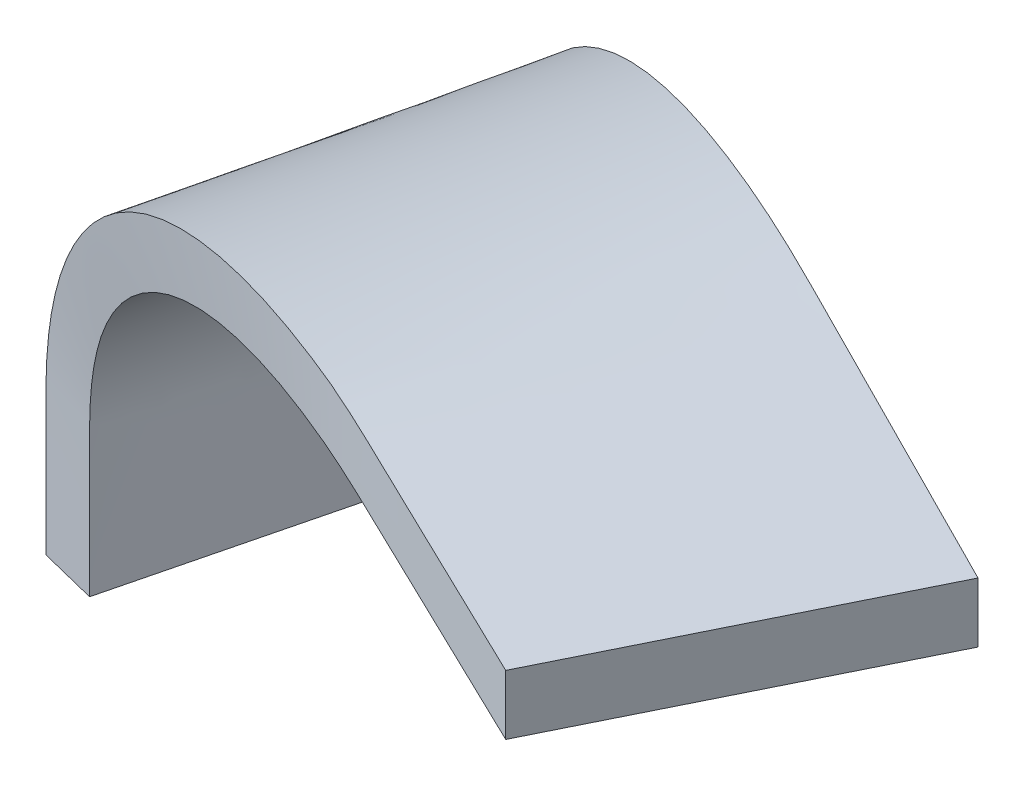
ISO-10303-21;
HEADER;
FILE_DESCRIPTION(('STEP AP214'),'2;1');
FILE_NAME('part.step','',(''),(''),'','','');
FILE_SCHEMA(('AUTOMOTIVE_DESIGN { 1 0 10303 214 1 1 1 1 }'));
ENDSEC;
DATA;
#1=APPLICATION_CONTEXT('core data for automotive mechanical design processes');
#2=APPLICATION_PROTOCOL_DEFINITION('international standard','automotive_design',2000,#1);
#3=PRODUCT_CONTEXT('',#1,'mechanical');
#4=PRODUCT('Part','Part','',(#3));
#5=PRODUCT_RELATED_PRODUCT_CATEGORY('part','',(#4));
#6=PRODUCT_DEFINITION_FORMATION('','',#4);
#7=PRODUCT_DEFINITION_CONTEXT('part definition',#1,'design');
#8=PRODUCT_DEFINITION('design','',#6,#7);
#9=PRODUCT_DEFINITION_SHAPE('','',#8);
#10=(LENGTH_UNIT() NAMED_UNIT(*) SI_UNIT(.MILLI.,.METRE.));
#11=(NAMED_UNIT(*) PLANE_ANGLE_UNIT() SI_UNIT($,.RADIAN.));
#12=(NAMED_UNIT(*) SI_UNIT($,.STERADIAN.) SOLID_ANGLE_UNIT());
#13=UNCERTAINTY_MEASURE_WITH_UNIT(LENGTH_MEASURE(1.E-05),#10,'distance_accuracy_value','');
#14=(GEOMETRIC_REPRESENTATION_CONTEXT(3) GLOBAL_UNCERTAINTY_ASSIGNED_CONTEXT((#13)) GLOBAL_UNIT_ASSIGNED_CONTEXT((#10,
#11,#12)) REPRESENTATION_CONTEXT('',''));
#15=CARTESIAN_POINT('',(0.,0.,0.));
#16=DIRECTION('',(0.,0.,1.));
#17=DIRECTION('',(1.,0.,0.));
#18=AXIS2_PLACEMENT_3D('',#15,#16,#17);
#19=CARTESIAN_POINT('',(-40.958936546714,37.2872000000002,-46.0681167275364));
#20=DIRECTION('',(-0.89667182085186,0.,-0.442695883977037));
#21=DIRECTION('',(-0.42954592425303,-0.241921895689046,0.870036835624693));
#22=AXIS2_PLACEMENT_3D('',#19,#20,#21);
#23=PLANE('',#22);
#24=DIRECTION('',(0.,-1.,0.));
#25=VECTOR('',#24,1.);
#26=CARTESIAN_POINT('',(-40.958936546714,33.2872000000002,-46.0681167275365));
#27=LINE('',#26,#25);
#28=CARTESIAN_POINT('',(-40.958936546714,37.2872000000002,-46.0681167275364));
#29=VERTEX_POINT('',#28);
#30=CARTESIAN_POINT('',(-40.958936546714,33.2872000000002,-46.0681167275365));
#31=VERTEX_POINT('',#30);
#32=EDGE_CURVE('E87',#29,#31,#27,.T.);
#33=ORIENTED_EDGE('',*,*,#32,.F.);
#34=DIRECTION('',(0.442695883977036,0.,-0.89667182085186));
#35=VECTOR('',#34,1.);
#36=CARTESIAN_POINT('',(-40.958936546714,37.2872000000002,-46.0681167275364));
#37=LINE('',#36,#35);
#38=CARTESIAN_POINT('',(-51.3958438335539,37.2871999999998,-24.928365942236));
#39=VERTEX_POINT('',#38);
#40=EDGE_CURVE('E97',#39,#29,#37,.T.);
#41=ORIENTED_EDGE('',*,*,#40,.F.);
#42=DIRECTION('',(0.,1.,0.));
#43=VECTOR('',#42,1.);
#44=CARTESIAN_POINT('',(-51.3958438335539,33.2871999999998,-24.9283659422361));
#45=LINE('',#44,#43);
#46=CARTESIAN_POINT('',(-51.3958438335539,33.2871999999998,-24.9283659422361));
#47=VERTEX_POINT('',#46);
#48=EDGE_CURVE('E103',#47,#39,#45,.T.);
#49=ORIENTED_EDGE('',*,*,#48,.F.);
#50=DIRECTION('',(-0.442695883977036,0.,0.89667182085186));
#51=VECTOR('',#50,1.);
#52=CARTESIAN_POINT('',(-40.958936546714,33.2872000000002,-46.0681167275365));
#53=LINE('',#52,#51);
#54=EDGE_CURVE('E109',#31,#47,#53,.T.);
#55=ORIENTED_EDGE('',*,*,#54,.F.);
#56=EDGE_LOOP('',(#33,#41,#49,#55));
#57=FACE_BOUND('',#56,.T.);
#58=ADVANCED_FACE('F38',(#57),#23,.F.);
#59=CARTESIAN_POINT('',(-104.594392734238,0.,-78.1789366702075));
#60=DIRECTION('',(0.,-1.,0.));
#61=DIRECTION('',(0.,0.,1.));
#62=AXIS2_PLACEMENT_3D('',#59,#60,#61);
#63=PLANE('',#62);
#64=DIRECTION('',(0.970295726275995,0.,0.241921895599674));
#65=VECTOR('',#64,1.);
#66=CARTESIAN_POINT('',(-100.713209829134,0.,-77.2112490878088));
#67=LINE('',#66,#65);
#68=CARTESIAN_POINT('',(-104.594392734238,0.,-78.1789366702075));
#69=VERTEX_POINT('',#68);
#70=CARTESIAN_POINT('',(-100.713209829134,0.,-77.2112490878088));
#71=VERTEX_POINT('',#70);
#72=EDGE_CURVE('E90',#69,#71,#67,.T.);
#73=ORIENTED_EDGE('',*,*,#72,.T.);
#74=DIRECTION('',(-0.241921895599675,0.,0.970295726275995));
#75=VECTOR('',#74,1.);
#76=CARTESIAN_POINT('',(-100.713209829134,0.,-77.2112490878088));
#77=LINE('',#76,#75);
#78=CARTESIAN_POINT('',(-106.858025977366,0.,-52.5657376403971));
#79=VERTEX_POINT('',#78);
#80=EDGE_CURVE('E179',#71,#79,#77,.T.);
#81=ORIENTED_EDGE('',*,*,#80,.T.);
#82=DIRECTION('',(-0.970295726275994,0.,-0.241921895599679));
#83=VECTOR('',#82,1.);
#84=CARTESIAN_POINT('',(-106.858025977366,0.,-52.5657376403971));
#85=LINE('',#84,#83);
#86=CARTESIAN_POINT('',(-110.73920888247,0.,-53.5334252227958));
#87=VERTEX_POINT('',#86);
#88=EDGE_CURVE('E174',#79,#87,#85,.T.);
#89=ORIENTED_EDGE('',*,*,#88,.T.);
#90=DIRECTION('',(0.241921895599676,0.,-0.970295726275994));
#91=VECTOR('',#90,1.);
#92=CARTESIAN_POINT('',(-104.594392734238,0.,-78.1789366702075));
#93=LINE('',#92,#91);
#94=EDGE_CURVE('E170',#87,#69,#93,.T.);
#95=ORIENTED_EDGE('',*,*,#94,.T.);
#96=EDGE_LOOP('',(#73,#81,#89,#95));
#97=FACE_BOUND('',#96,.T.);
#98=ADVANCED_FACE('F134',(#97),#63,.T.);
#99=CARTESIAN_POINT('',(-110.73920888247,0.,-53.5334252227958));
#100=CARTESIAN_POINT('',(-110.739173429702,0.528604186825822,-53.5334084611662));
#101=CARTESIAN_POINT('',(-110.739102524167,1.5858125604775,-53.5333749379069));
#102=CARTESIAN_POINT('',(-110.7397457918,3.51629606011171,-53.5336790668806));
#103=CARTESIAN_POINT('',(-110.736922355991,5.05900053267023,-53.532344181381));
#104=CARTESIAN_POINT('',(-110.739998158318,6.92988317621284,-53.5337983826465));
#105=CARTESIAN_POINT('',(-110.747378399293,8.30169752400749,-53.5372876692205));
#106=CARTESIAN_POINT('',(-110.739499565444,9.74768665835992,-53.5335626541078));
#107=CARTESIAN_POINT('',(-110.722319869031,10.4352591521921,-53.5254403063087));
#108=CARTESIAN_POINT('',(-110.663751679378,11.2281034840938,-53.497725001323));
#109=CARTESIAN_POINT('',(-110.568899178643,12.1016220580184,-53.452821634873));
#110=CARTESIAN_POINT('',(-110.4141906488,13.0108488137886,-53.3795059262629));
#111=CARTESIAN_POINT('',(-110.22123056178,13.8728082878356,-53.2879265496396));
#112=CARTESIAN_POINT('',(-110.058060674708,14.5010072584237,-53.2104181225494));
#113=CARTESIAN_POINT('',(-109.84566695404,15.2058075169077,-53.1093988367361));
#114=CARTESIAN_POINT('',(-109.480812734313,16.2688917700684,-52.9356750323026));
#115=CARTESIAN_POINT('',(-109.017022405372,17.368760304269,-52.7144522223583));
#116=CARTESIAN_POINT('',(-108.531404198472,18.3321247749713,-52.4824142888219));
#117=CARTESIAN_POINT('',(-108.147344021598,19.0401489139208,-52.2987713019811));
#118=CARTESIAN_POINT('',(-107.775746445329,19.6692613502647,-52.1209264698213));
#119=CARTESIAN_POINT('',(-107.123484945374,20.6817031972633,-51.8084945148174));
#120=CARTESIAN_POINT('',(-106.277905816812,21.8569486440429,-51.4030726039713));
#121=CARTESIAN_POINT('',(-105.345399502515,22.9729170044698,-50.9554339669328));
#122=CARTESIAN_POINT('',(-104.406864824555,23.9970788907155,-50.5045883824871));
#123=CARTESIAN_POINT('',(-103.669742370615,24.7395433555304,-50.1502993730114));
#124=CARTESIAN_POINT('',(-102.716670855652,25.6243838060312,-49.691977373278));
#125=CARTESIAN_POINT('',(-101.860218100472,26.3663931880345,-49.2799577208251));
#126=CARTESIAN_POINT('',(-100.900247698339,27.1384351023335,-48.8179759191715));
#127=CARTESIAN_POINT('',(-99.6579887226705,28.0726213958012,-48.2199624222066));
#128=CARTESIAN_POINT('',(-98.2188563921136,29.0508372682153,-47.5268761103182));
#129=CARTESIAN_POINT('',(-96.06656008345,30.362556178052,-46.4899199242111));
#130=CARTESIAN_POINT('',(-94.0818986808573,31.4176959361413,-45.5333687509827));
#131=CARTESIAN_POINT('',(-92.3354868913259,32.2304752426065,-44.6913809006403));
#132=CARTESIAN_POINT('',(-90.0710508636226,33.2227122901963,-43.5995042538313));
#133=CARTESIAN_POINT('',(-88.0513252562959,33.9749664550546,-42.6253351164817));
#134=CARTESIAN_POINT('',(-85.5973238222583,34.754089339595,-41.4414569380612));
#135=CARTESIAN_POINT('',(-84.1901824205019,35.1663248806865,-40.7625423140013));
#136=CARTESIAN_POINT('',(-81.8940367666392,35.761505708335,-39.6545552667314));
#137=CARTESIAN_POINT('',(-79.929841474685,36.1868549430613,-38.7065893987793));
#138=CARTESIAN_POINT('',(-78.2342589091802,36.498282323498,-37.8881573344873));
#139=CARTESIAN_POINT('',(-77.4120706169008,36.6357452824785,-37.4912745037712));
#140=CARTESIAN_POINT('',(-76.0854986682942,36.8440169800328,-36.8508880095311));
#141=CARTESIAN_POINT('',(-74.3734542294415,37.0862250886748,-36.0243497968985));
#142=CARTESIAN_POINT('',(-72.3113764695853,37.2374311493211,-35.0286334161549));
#143=CARTESIAN_POINT('',(-69.8759804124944,37.3150406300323,-33.8525696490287));
#144=CARTESIAN_POINT('',(-68.0416909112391,37.2949569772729,-32.9667750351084));
#145=CARTESIAN_POINT('',(-65.4784523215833,37.2805933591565,-31.7289658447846));
#146=CARTESIAN_POINT('',(-63.7492540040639,37.2868138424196,-30.8939232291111));
#147=CARTESIAN_POINT('',(-61.2294423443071,37.2884947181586,-29.6770868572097));
#148=CARTESIAN_POINT('',(-58.6880200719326,37.2865103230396,-28.4498141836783));
#149=CARTESIAN_POINT('',(-55.2295429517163,37.2873939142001,-26.7796889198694));
#150=CARTESIAN_POINT('',(-52.6665485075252,37.2872642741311,-25.5419990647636));
#151=CARTESIAN_POINT('',(-51.3958438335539,37.2871999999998,-24.928365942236));
#152=CARTESIAN_POINT('',(-109.919900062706,0.,-56.8194934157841));
#153=CARTESIAN_POINT('',(-109.919814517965,0.528310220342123,-56.8194517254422));
#154=CARTESIAN_POINT('',(-109.919643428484,1.58493066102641,-56.8193683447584));
#155=CARTESIAN_POINT('',(-109.919533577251,3.50834241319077,-56.8193042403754));
#156=CARTESIAN_POINT('',(-109.917394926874,5.06275502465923,-56.8182916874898));
#157=CARTESIAN_POINT('',(-109.920715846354,6.92931201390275,-56.8198840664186));
#158=CARTESIAN_POINT('',(-109.927044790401,8.27696047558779,-56.8228954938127));
#159=CARTESIAN_POINT('',(-109.919765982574,9.74190568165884,-56.8194227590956));
#160=CARTESIAN_POINT('',(-109.90009257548,10.4850648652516,-56.8099733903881));
#161=CARTESIAN_POINT('',(-109.83630335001,11.3220863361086,-56.7793603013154));
#162=CARTESIAN_POINT('',(-109.731351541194,12.2338823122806,-56.7289571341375));
#163=CARTESIAN_POINT('',(-109.557785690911,13.1840108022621,-56.6455139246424));
#164=CARTESIAN_POINT('',(-109.344476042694,14.0818749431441,-56.5429045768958));
#165=CARTESIAN_POINT('',(-109.165598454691,14.7340014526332,-56.4568277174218));
#166=CARTESIAN_POINT('',(-108.934762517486,15.4634112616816,-56.3456788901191));
#167=CARTESIAN_POINT('',(-108.540948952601,16.5601094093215,-56.1559486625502));
#168=CARTESIAN_POINT('',(-108.045228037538,17.6881778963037,-55.9168933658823));
#169=CARTESIAN_POINT('',(-107.530108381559,18.6704446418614,-55.6682324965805));
#170=CARTESIAN_POINT('',(-107.124167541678,19.3906996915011,-55.4721944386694));
#171=CARTESIAN_POINT('',(-106.733346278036,20.0285942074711,-55.283360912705));
#172=CARTESIAN_POINT('',(-106.050699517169,21.0519614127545,-54.9533684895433));
#173=CARTESIAN_POINT('',(-105.170414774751,22.2353122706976,-54.527599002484));
#174=CARTESIAN_POINT('',(-104.206098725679,23.3536904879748,-54.0608558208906));
#175=CARTESIAN_POINT('',(-103.239315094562,24.3776411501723,-53.5927252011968));
#176=CARTESIAN_POINT('',(-102.482446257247,25.1182338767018,-53.226117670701));
#177=CARTESIAN_POINT('',(-101.506695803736,25.9986425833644,-52.7533404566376));
#178=CARTESIAN_POINT('',(-100.631744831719,26.7352209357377,-52.3293028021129));
#179=CARTESIAN_POINT('',(-99.6531983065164,27.5001808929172,-51.8549590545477));
#180=CARTESIAN_POINT('',(-98.3895637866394,28.424030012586,-51.2423116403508));
#181=CARTESIAN_POINT('',(-96.9297949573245,29.389125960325,-50.5343894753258));
#182=CARTESIAN_POINT('',(-94.7513788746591,30.6789681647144,-49.4776965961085));
#183=CARTESIAN_POINT('',(-92.7462023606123,31.7114206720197,-48.5048046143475));
#184=CARTESIAN_POINT('',(-90.9847684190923,32.5037942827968,-47.6500046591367));
#185=CARTESIAN_POINT('',(-88.7025651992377,33.469128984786,-46.5423966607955));
#186=CARTESIAN_POINT('',(-86.6704080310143,34.1959647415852,-45.5559593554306));
#187=CARTESIAN_POINT('',(-84.2041745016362,34.9433050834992,-44.3586588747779));
#188=CARTESIAN_POINT('',(-82.7908273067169,35.3368716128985,-43.6724656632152));
#189=CARTESIAN_POINT('',(-80.4866999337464,35.9012727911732,-42.5536997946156));
#190=CARTESIAN_POINT('',(-78.5182254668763,36.2997637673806,-41.597814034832));
#191=CARTESIAN_POINT('',(-76.8201018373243,36.5866655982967,-40.773142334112));
#192=CARTESIAN_POINT('',(-75.9969494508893,36.7123248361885,-40.3733729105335));
#193=CARTESIAN_POINT('',(-74.6690805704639,36.9004391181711,-39.7284646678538));
#194=CARTESIAN_POINT('',(-72.955977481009,37.1121924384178,-38.8964130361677));
#195=CARTESIAN_POINT('',(-70.8954321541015,37.2452148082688,-37.8954926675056));
#196=CARTESIAN_POINT('',(-68.463436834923,37.3115026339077,-36.7140903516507));
#197=CARTESIAN_POINT('',(-66.6316063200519,37.2929642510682,-35.8242264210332));
#198=CARTESIAN_POINT('',(-64.0712336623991,37.2807542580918,-34.580448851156));
#199=CARTESIAN_POINT('',(-62.3435857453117,37.2865938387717,-33.7411903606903));
#200=CARTESIAN_POINT('',(-59.8262327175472,37.2894184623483,-32.5183091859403));
#201=CARTESIAN_POINT('',(-57.2876051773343,37.2884314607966,-31.2850954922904));
#202=CARTESIAN_POINT('',(-53.8334001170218,37.28796172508,-29.6071168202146));
#203=CARTESIAN_POINT('',(-51.2734510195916,37.2874524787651,-28.3635474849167));
#204=CARTESIAN_POINT('',(-50.0042561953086,37.2871999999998,-27.746999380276));
#205=CARTESIAN_POINT('',(-109.049384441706,0.,-60.310940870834));
#206=CARTESIAN_POINT('',(-109.049245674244,0.527997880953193,-60.3108726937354));
#207=CARTESIAN_POINT('',(-109.048968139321,1.58399364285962,-60.3107363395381));
#208=CARTESIAN_POINT('',(-109.048058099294,3.49989166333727,-60.3102809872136));
#209=CARTESIAN_POINT('',(-109.046647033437,5.06674417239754,-60.3096109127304));
#210=CARTESIAN_POINT('',(-109.050228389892,6.92870515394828,-60.3113501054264));
#211=CARTESIAN_POINT('',(-109.055440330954,8.25067736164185,-60.3138538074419));
#212=CARTESIAN_POINT('',(-109.048799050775,9.73576339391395,-60.3106491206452));
#213=CARTESIAN_POINT('',(-109.026476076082,10.5379834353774,-60.2997897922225));
#214=CARTESIAN_POINT('',(-108.957139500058,11.4219431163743,-60.2660978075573));
#215=CARTESIAN_POINT('',(-108.841457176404,12.3744088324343,-60.2098511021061));
#216=CARTESIAN_POINT('',(-108.647855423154,13.3679954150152,-60.1156474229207));
#217=CARTESIAN_POINT('',(-108.412924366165,14.3040082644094,-60.0013187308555));
#218=CARTESIAN_POINT('',(-108.217357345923,14.9815577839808,-59.9061379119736));
#219=CARTESIAN_POINT('',(-107.966926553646,15.7371152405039,-59.7842264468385));
#220=CARTESIAN_POINT('',(-107.542343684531,16.869528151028,-59.5774893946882));
#221=CARTESIAN_POINT('',(-107.012696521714,18.0275590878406,-59.3194870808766));
#222=CARTESIAN_POINT('',(-106.466231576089,19.0299095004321,-59.0531643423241));
#223=CARTESIAN_POINT('',(-106.037042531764,19.7631598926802,-58.8439565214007));
#224=CARTESIAN_POINT('',(-105.625796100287,20.4103853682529,-58.6434475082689));
#225=CARTESIAN_POINT('',(-104.910864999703,21.4453607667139,-58.2947970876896));
#226=CARTESIAN_POINT('',(-103.993705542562,22.6373236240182,-57.8474083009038));
#227=CARTESIAN_POINT('',(-102.995591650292,23.7582623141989,-57.3603665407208));
#228=CARTESIAN_POINT('',(-101.998793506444,24.7819885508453,-56.8738705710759));
#229=CARTESIAN_POINT('',(-101.220944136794,25.5205925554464,-56.4941746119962));
#230=CARTESIAN_POINT('',(-100.221097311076,26.396292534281,-56.0060387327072));
#231=CARTESIAN_POINT('',(-99.3264919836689,27.1271004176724,-55.5692319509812));
#232=CARTESIAN_POINT('',(-98.3282083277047,27.8845357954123,-55.0817536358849));
#233=CARTESIAN_POINT('',(-97.0418622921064,28.7974016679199,-54.4535576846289));
#234=CARTESIAN_POINT('',(-95.5601671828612,29.7485576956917,-53.7298724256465));
#235=CARTESIAN_POINT('',(-93.3539988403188,31.0151559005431,-52.6522093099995));
#236=CARTESIAN_POINT('',(-91.3270250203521,32.0235032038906,-51.6619552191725));
#237=CARTESIAN_POINT('',(-89.5496300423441,32.794195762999,-50.7935424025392));
#238=CARTESIAN_POINT('',(-87.2485491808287,33.7309467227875,-49.669219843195));
#239=CARTESIAN_POINT('',(-85.2031834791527,34.4307754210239,-48.6697476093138));
#240=CARTESIAN_POINT('',(-82.7239533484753,35.1443468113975,-47.4581859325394));
#241=CARTESIAN_POINT('',(-81.3040124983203,35.5180775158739,-46.764259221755));
#242=CARTESIAN_POINT('',(-78.9914045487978,36.0497753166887,-45.6340408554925));
#243=CARTESIAN_POINT('',(-77.0183834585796,36.4197293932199,-44.6697402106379));
#244=CARTESIAN_POINT('',(-75.3175599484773,36.6805728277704,-43.8384388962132));
#245=CARTESIAN_POINT('',(-74.4933832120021,36.7936906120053,-43.4356024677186));
#246=CARTESIAN_POINT('',(-73.1641363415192,36.960387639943,-42.7858898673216));
#247=CARTESIAN_POINT('',(-71.4499084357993,37.1397827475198,-41.9479802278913));
#248=CARTESIAN_POINT('',(-69.3909913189,37.2534849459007,-40.9415306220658));
#249=CARTESIAN_POINT('',(-66.9626092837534,37.3077435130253,-39.7544560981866));
#250=CARTESIAN_POINT('',(-65.1333914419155,37.2908469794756,-38.8602685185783));
#251=CARTESIAN_POINT('',(-62.5760638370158,37.2809252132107,-37.6101495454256));
#252=CARTESIAN_POINT('',(-60.8500632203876,37.2863600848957,-36.7664116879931));
#253=CARTESIAN_POINT('',(-58.3353224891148,37.2903999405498,-35.5371079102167));
#254=CARTESIAN_POINT('',(-55.7996643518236,37.2904726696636,-34.2975818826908));
#255=CARTESIAN_POINT('',(-52.349998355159,37.2885650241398,-32.6112589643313));
#256=CARTESIAN_POINT('',(-49.793284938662,37.2876524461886,-31.3614426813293));
#257=CARTESIAN_POINT('',(-48.525694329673,37.2871999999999,-30.7417974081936));
#258=CARTESIAN_POINT('',(-108.127662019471,0.,-64.0077675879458));
#259=CARTESIAN_POINT('',(-108.12746689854,0.527667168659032,-64.0076713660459));
#260=CARTESIAN_POINT('',(-108.127076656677,1.58300150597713,-64.007478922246));
#261=CARTESIAN_POINT('',(-108.125319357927,3.49094381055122,-64.0066093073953));
#262=CARTESIAN_POINT('',(-108.12467867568,5.07096797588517,-64.0063018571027));
#263=CARTESIAN_POINT('',(-108.128535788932,6.92806259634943,-64.00819649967));
#264=CARTESIAN_POINT('',(-108.13256502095,8.22284818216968,-64.0101626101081));
#265=CARTESIAN_POINT('',(-108.126598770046,9.72925979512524,-64.0072417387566));
#266=CARTESIAN_POINT('',(-108.101470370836,10.5940148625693,-63.9948895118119));
#267=CARTESIAN_POINT('',(-108.026260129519,11.5276738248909,-63.9579375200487));
#268=CARTESIAN_POINT('',(-107.899216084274,12.5232016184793,-63.8955035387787));
#269=CARTESIAN_POINT('',(-107.684399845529,13.5628026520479,-63.7899064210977));
#270=CARTESIAN_POINT('',(-107.426575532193,14.5392082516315,-63.6631690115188));
#271=CARTESIAN_POINT('',(-107.213337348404,15.2436762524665,-63.558348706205));
#272=CARTESIAN_POINT('',(-106.942159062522,16.0269194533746,-63.4250415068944));
#273=CARTESIAN_POINT('',(-106.484996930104,17.1971479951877,-63.2002972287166));
#274=CARTESIAN_POINT('',(-105.919427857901,18.3869038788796,-62.9222333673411));
#275=CARTESIAN_POINT('',(-105.339773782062,19.4105193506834,-62.6372098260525));
#276=CARTESIAN_POINT('',(-104.885968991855,20.1575295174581,-62.414057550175));
#277=CARTESIAN_POINT('',(-104.453095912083,20.8146348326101,-62.201186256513));
#278=CARTESIAN_POINT('',(-103.703981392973,21.8619012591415,-61.8327803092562));
#279=CARTESIAN_POINT('',(-102.747778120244,23.0629827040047,-61.3625004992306));
#280=CARTESIAN_POINT('',(-101.713878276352,24.186632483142,-60.8539661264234));
#281=CARTESIAN_POINT('',(-100.685300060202,25.2101210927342,-60.3480244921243));
#282=CARTESIAN_POINT('',(-99.8852360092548,25.9466193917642,-59.9544701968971));
#283=CARTESIAN_POINT('',(-98.8598753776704,26.817333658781,-59.4500722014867));
#284=CARTESIAN_POINT('',(-97.9445593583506,27.5422964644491,-58.9997944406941));
#285=CARTESIAN_POINT('',(-96.925277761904,28.291499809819,-58.4983596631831));
#286=CARTESIAN_POINT('',(-95.6148842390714,29.1927363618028,-57.8537005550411));
#287=CARTESIAN_POINT('',(-94.1099730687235,30.1291324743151,-57.1133249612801));
#288=CARTESIAN_POINT('',(-91.874419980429,31.3711193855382,-56.0134580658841));
#289=CARTESIAN_POINT('',(-89.8243666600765,32.3539435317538,-55.0048205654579));
#290=CARTESIAN_POINT('',(-88.0300717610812,33.1016796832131,-54.1219941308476));
#291=CARTESIAN_POINT('',(-85.7090028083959,34.0081655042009,-52.9799738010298));
#292=CARTESIAN_POINT('',(-83.6496516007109,34.6793984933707,-51.9666998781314));
#293=CARTESIAN_POINT('',(-81.1565020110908,35.3567224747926,-50.7399599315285));
#294=CARTESIAN_POINT('',(-79.7297379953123,35.7099425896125,-50.0379229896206));
#295=CARTESIAN_POINT('',(-77.4081506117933,36.2070132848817,-48.8955784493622));
#296=CARTESIAN_POINT('',(-75.4303154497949,36.5467518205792,-47.9223679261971));
#297=CARTESIAN_POINT('',(-73.7266332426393,36.7800040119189,-47.084047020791));
#298=CARTESIAN_POINT('',(-72.9013719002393,36.879842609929,-46.6779631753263));
#299=CARTESIAN_POINT('',(-71.5706659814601,37.0238625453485,-46.0231636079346));
#300=CARTESIAN_POINT('',(-69.8552470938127,37.1689960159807,-45.1790513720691));
#301=CARTESIAN_POINT('',(-67.7980539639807,37.2622415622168,-44.1667472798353));
#302=CARTESIAN_POINT('',(-65.3734977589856,37.3037632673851,-42.9736668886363));
#303=CARTESIAN_POINT('',(-63.5470462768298,37.2886051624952,-42.0749013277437));
#304=CARTESIAN_POINT('',(-60.9929428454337,37.2811062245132,-40.8180679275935));
#305=CARTESIAN_POINT('',(-59.2686864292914,37.2861125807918,-39.9695872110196));
#306=CARTESIAN_POINT('',(-56.7567116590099,37.2914391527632,-38.7334830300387));
#307=CARTESIAN_POINT('',(-54.2241975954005,37.2926339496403,-37.4872733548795));
#308=CARTESIAN_POINT('',(-50.7793376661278,37.2892038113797,-35.7921153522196));
#309=CARTESIAN_POINT('',(-48.2260502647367,37.2878641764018,-34.5356846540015));
#310=CARTESIAN_POINT('',(-46.960158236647,37.2872,-33.9127600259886));
#311=CARTESIAN_POINT('',(-107.974041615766,0.,-64.6239053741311));
#312=CARTESIAN_POINT('',(-107.973837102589,0.527612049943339,-64.6238044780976));
#313=CARTESIAN_POINT('',(-107.973428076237,1.58283614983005,-64.6236026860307));
#314=CARTESIAN_POINT('',(-107.971529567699,3.48945250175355,-64.6226640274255));
#315=CARTESIAN_POINT('',(-107.97101728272,5.0716719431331,-64.6224170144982));
#316=CARTESIAN_POINT('',(-107.974920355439,6.92795550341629,-64.6243375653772));
#317=CARTESIAN_POINT('',(-107.978752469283,8.21820998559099,-64.6262140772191));
#318=CARTESIAN_POINT('',(-107.972898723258,9.72817586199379,-64.6233405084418));
#319=CARTESIAN_POINT('',(-107.947302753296,10.603353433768,-64.6107394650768));
#320=CARTESIAN_POINT('',(-107.871113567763,11.5452956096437,-64.5732441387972));
#321=CARTESIAN_POINT('',(-107.742175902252,12.5480004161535,-64.5097789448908));
#322=CARTESIAN_POINT('',(-107.523823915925,13.5952705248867,-64.4022829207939));
#323=CARTESIAN_POINT('',(-107.262184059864,14.5784082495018,-64.2734773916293));
#324=CARTESIAN_POINT('',(-107.046000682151,15.2873626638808,-64.1670505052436));
#325=CARTESIAN_POINT('',(-106.771364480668,16.0752201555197,-64.0318440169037));
#326=CARTESIAN_POINT('',(-106.308772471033,17.2517513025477,-63.8040985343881));
#327=CARTESIAN_POINT('',(-105.737216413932,18.4467946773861,-63.5226910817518));
#328=CARTESIAN_POINT('',(-105.152030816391,19.4739543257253,-63.2345507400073));
#329=CARTESIAN_POINT('',(-104.69412340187,20.2232577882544,-63.009074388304));
#330=CARTESIAN_POINT('',(-104.257645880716,20.8820097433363,-62.7941427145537));
#331=CARTESIAN_POINT('',(-103.502834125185,21.9313246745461,-62.4224441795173));
#332=CARTESIAN_POINT('',(-102.540123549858,23.1339258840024,-61.9483491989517));
#333=CARTESIAN_POINT('',(-101.500259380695,24.2580275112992,-61.4362327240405));
#334=CARTESIAN_POINT('',(-100.466384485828,25.2814765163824,-60.9270501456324));
#335=CARTESIAN_POINT('',(-99.6626179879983,26.0176238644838,-60.5311861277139));
#336=CARTESIAN_POINT('',(-98.6330050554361,26.8875071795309,-60.0240777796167));
#337=CARTESIAN_POINT('',(-97.7142393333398,27.6115013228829,-59.5715558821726));
#338=CARTESIAN_POINT('',(-96.6914560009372,28.3593271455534,-59.0677940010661));
#339=CARTESIAN_POINT('',(-95.3770545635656,29.2586254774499,-58.4203910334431));
#340=CARTESIAN_POINT('',(-93.8682740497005,30.1925616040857,-57.677233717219));
#341=CARTESIAN_POINT('',(-91.6278235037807,31.4304466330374,-56.5736661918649));
#342=CARTESIAN_POINT('',(-89.5739236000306,32.409016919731,-55.5619647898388));
#343=CARTESIAN_POINT('',(-87.7768120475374,33.1529270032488,-54.6767360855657));
#344=CARTESIAN_POINT('',(-85.4524117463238,34.0543686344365,-53.5317661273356));
#345=CARTESIAN_POINT('',(-83.3907296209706,34.7208356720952,-52.5161919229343));
#346=CARTESIAN_POINT('',(-80.8952568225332,35.3921081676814,-51.2869206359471));
#347=CARTESIAN_POINT('',(-79.4673589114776,35.7419201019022,-50.5835336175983));
#348=CARTESIAN_POINT('',(-77.1442749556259,36.2332196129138,-49.4391680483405));
#349=CARTESIAN_POINT('',(-75.1656374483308,36.567922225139,-48.464472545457));
#350=CARTESIAN_POINT('',(-73.4614787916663,36.7965758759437,-47.6249817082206));
#351=CARTESIAN_POINT('',(-72.6360366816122,36.8942012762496,-47.2183566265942));
#352=CARTESIAN_POINT('',(-71.3050875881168,37.0344416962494,-46.5627092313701));
#353=CARTESIAN_POINT('',(-69.5894702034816,37.1738648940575,-45.7175632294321));
#354=CARTESIAN_POINT('',(-67.5325644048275,37.2637009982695,-44.7042833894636));
#355=CARTESIAN_POINT('',(-65.108645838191,37.3030998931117,-43.5102020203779));
#356=CARTESIAN_POINT('',(-63.2826554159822,37.2882315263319,-42.6106734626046));
#357=CARTESIAN_POINT('',(-60.7290893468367,37.2811363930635,-41.3527209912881));
#358=CARTESIAN_POINT('',(-59.0051236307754,37.2860713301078,-40.5034497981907));
#359=CARTESIAN_POINT('',(-56.4936098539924,37.2916123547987,-39.2662122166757));
#360=CARTESIAN_POINT('',(-53.9616198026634,37.2929941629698,-38.0188886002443));
#361=CARTESIAN_POINT('',(-50.5175608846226,37.2893102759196,-36.3222580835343));
#362=CARTESIAN_POINT('',(-47.9648444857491,37.2878994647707,-35.0647249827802));
#363=CARTESIAN_POINT('',(-46.699235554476,37.2872,-34.4412537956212));
#364=CARTESIAN_POINT('',(-107.82042121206,0.,-65.2400431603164));
#365=CARTESIAN_POINT('',(-107.820207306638,0.527556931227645,-65.2399375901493));
#366=CARTESIAN_POINT('',(-107.819779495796,1.58267079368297,-65.2397264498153));
#367=CARTESIAN_POINT('',(-107.817739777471,3.48796119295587,-65.2387187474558));
#368=CARTESIAN_POINT('',(-107.817355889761,5.07237591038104,-65.2385321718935));
#369=CARTESIAN_POINT('',(-107.821304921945,6.92784841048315,-65.2404786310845));
#370=CARTESIAN_POINT('',(-107.824939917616,8.21357178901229,-65.2422655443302));
#371=CARTESIAN_POINT('',(-107.81919867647,9.72709192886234,-65.2394392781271));
#372=CARTESIAN_POINT('',(-107.793135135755,10.6126920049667,-65.2265894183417));
#373=CARTESIAN_POINT('',(-107.715967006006,11.5629173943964,-65.1885507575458));
#374=CARTESIAN_POINT('',(-107.585135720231,12.5727992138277,-65.124054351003));
#375=CARTESIAN_POINT('',(-107.36324798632,13.6277383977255,-65.01465942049));
#376=CARTESIAN_POINT('',(-107.097792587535,14.6176082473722,-64.8837857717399));
#377=CARTESIAN_POINT('',(-106.878664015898,15.3310490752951,-64.7757523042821));
#378=CARTESIAN_POINT('',(-106.600569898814,16.1235208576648,-64.638646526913));
#379=CARTESIAN_POINT('',(-106.132548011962,17.3063546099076,-64.4078998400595));
#380=CARTESIAN_POINT('',(-105.555004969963,18.5066854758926,-64.1231487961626));
#381=CARTESIAN_POINT('',(-104.96428785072,19.5373893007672,-63.831891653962));
#382=CARTESIAN_POINT('',(-104.502277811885,20.2889860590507,-63.6040912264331));
#383=CARTESIAN_POINT('',(-104.062195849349,20.9493846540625,-63.3870991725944));
#384=CARTESIAN_POINT('',(-103.301686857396,22.0007480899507,-63.0121080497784));
#385=CARTESIAN_POINT('',(-102.332468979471,23.2048690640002,-62.5341978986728));
#386=CARTESIAN_POINT('',(-101.286640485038,24.3294225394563,-62.0184993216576));
#387=CARTESIAN_POINT('',(-100.247468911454,25.3528319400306,-61.5060757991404));
#388=CARTESIAN_POINT('',(-99.4399999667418,26.0886283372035,-61.1079020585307));
#389=CARTESIAN_POINT('',(-98.4061347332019,26.9576807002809,-60.5980833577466));
#390=CARTESIAN_POINT('',(-97.4839215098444,27.6807120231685,-60.1433184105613));
#391=CARTESIAN_POINT('',(-96.4576342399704,28.4271544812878,-59.6372283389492));
#392=CARTESIAN_POINT('',(-95.1392248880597,29.3245145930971,-58.9870815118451));
#393=CARTESIAN_POINT('',(-93.6265750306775,30.2559907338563,-58.2411424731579));
#394=CARTESIAN_POINT('',(-91.3812270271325,31.4897738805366,-57.1338743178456));
#395=CARTESIAN_POINT('',(-89.3234805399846,32.4640903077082,-56.1191090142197));
#396=CARTESIAN_POINT('',(-87.5235523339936,33.2041743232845,-55.2314780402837));
#397=CARTESIAN_POINT('',(-85.1958206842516,34.100571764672,-54.0835584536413));
#398=CARTESIAN_POINT('',(-83.1318076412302,34.7622728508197,-53.0656839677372));
#399=CARTESIAN_POINT('',(-80.6340081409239,35.4274830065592,-51.833879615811));
#400=CARTESIAN_POINT('',(-79.2049798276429,35.773897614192,-51.1291442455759));
#401=CARTESIAN_POINT('',(-76.8803992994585,36.259425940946,-49.9827576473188));
#402=CARTESIAN_POINT('',(-74.9009594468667,36.5890926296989,-49.0065771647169));
#403=CARTESIAN_POINT('',(-73.1963243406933,36.8131477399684,-48.1659163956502));
#404=CARTESIAN_POINT('',(-72.370701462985,36.9085599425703,-47.7587500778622));
#405=CARTESIAN_POINT('',(-71.0395091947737,37.0450208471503,-47.1022548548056));
#406=CARTESIAN_POINT('',(-69.3236933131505,37.1787337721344,-46.2560750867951));
#407=CARTESIAN_POINT('',(-67.2670748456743,37.2651604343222,-45.2418194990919));
#408=CARTESIAN_POINT('',(-64.8437939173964,37.3024365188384,-44.0467371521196));
#409=CARTESIAN_POINT('',(-63.0182645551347,37.2878578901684,-43.1464455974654));
#410=CARTESIAN_POINT('',(-60.4652358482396,37.2811665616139,-41.8873740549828));
#411=CARTESIAN_POINT('',(-58.7415608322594,37.2860300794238,-41.0373123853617));
#412=CARTESIAN_POINT('',(-56.230508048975,37.2917855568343,-39.7989414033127));
#413=CARTESIAN_POINT('',(-53.6990420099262,37.2933543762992,-38.5505038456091));
#414=CARTESIAN_POINT('',(-50.2557841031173,37.2894167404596,-36.8524008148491));
#415=CARTESIAN_POINT('',(-47.7036387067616,37.2879347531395,-35.5937653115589));
#416=CARTESIAN_POINT('',(-46.438312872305,37.2872,-34.9697475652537));
#417=CARTESIAN_POINT('',(-107.718007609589,0.,-65.6508016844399));
#418=CARTESIAN_POINT('',(-107.717787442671,0.527520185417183,-65.6506929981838));
#419=CARTESIAN_POINT('',(-107.717347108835,1.58256055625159,-65.6504756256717));
#420=CARTESIAN_POINT('',(-107.715213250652,3.48696698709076,-65.6494218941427));
#421=CARTESIAN_POINT('',(-107.714914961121,5.07284522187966,-65.6492756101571));
#422=CARTESIAN_POINT('',(-107.71889463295,6.92777701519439,-65.6512393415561));
#423=CARTESIAN_POINT('',(-107.722398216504,8.21047965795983,-65.6529665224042));
#424=CARTESIAN_POINT('',(-107.716731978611,9.72636930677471,-65.6501717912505));
#425=CARTESIAN_POINT('',(-107.690356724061,10.6189177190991,-65.6371560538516));
#426=CARTESIAN_POINT('',(-107.612535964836,11.5746652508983,-65.5987551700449));
#427=CARTESIAN_POINT('',(-107.480442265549,12.5893317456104,-65.533571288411));
#428=CARTESIAN_POINT('',(-107.256197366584,13.6493836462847,-65.4229104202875));
#429=CARTESIAN_POINT('',(-106.98819827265,14.6437415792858,-65.2906580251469));
#430=CARTESIAN_POINT('',(-106.767106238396,15.3601733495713,-65.1815535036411));
#431=CARTESIAN_POINT('',(-106.486706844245,16.1557213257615,-65.0431815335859));
#432=CARTESIAN_POINT('',(-106.015065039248,17.3427568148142,-64.8104340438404));
#433=CARTESIAN_POINT('',(-105.433530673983,18.546612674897,-64.5234539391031));
#434=CARTESIAN_POINT('',(-104.839125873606,19.5796792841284,-64.2301189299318));
#435=CARTESIAN_POINT('',(-104.374380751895,20.3328049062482,-64.0007691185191));
#436=CARTESIAN_POINT('',(-103.931895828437,20.9943012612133,-63.7824034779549));
#437=CARTESIAN_POINT('',(-103.167588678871,22.0470303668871,-63.4052172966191));
#438=CARTESIAN_POINT('',(-102.194032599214,23.252164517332,-62.9247636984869));
#439=CARTESIAN_POINT('',(-101.144227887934,24.3770192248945,-62.4066770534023));
#440=CARTESIAN_POINT('',(-100.101525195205,25.4004022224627,-61.8920929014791));
#441=CARTESIAN_POINT('',(-99.2915879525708,26.1359646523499,-61.4923793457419));
#442=CARTESIAN_POINT('',(-98.2548878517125,27.0044630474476,-60.9807537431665));
#443=CARTESIAN_POINT('',(-97.3303778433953,27.7268566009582,-60.5244941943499));
#444=CARTESIAN_POINT('',(-96.3017530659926,28.4723727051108,-60.0168512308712));
#445=CARTESIAN_POINT('',(-94.9806717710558,29.3684406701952,-59.3648751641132));
#446=CARTESIAN_POINT('',(-93.4654423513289,30.29827682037,-58.6170816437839));
#447=CARTESIAN_POINT('',(-91.2168293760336,31.5293253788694,-57.5073464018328));
#448=CARTESIAN_POINT('',(-89.1565184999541,32.500805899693,-56.4905384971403));
#449=CARTESIAN_POINT('',(-87.3547125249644,33.2383392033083,-55.6013060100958));
#450=CARTESIAN_POINT('',(-85.0247599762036,34.1313738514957,-54.4514200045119));
#451=CARTESIAN_POINT('',(-82.95919298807,34.789897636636,-53.4320119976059));
#452=CARTESIAN_POINT('',(-80.4598398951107,35.4510585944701,-52.1985177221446));
#453=CARTESIAN_POINT('',(-79.0300604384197,35.7952159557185,-51.4928846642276));
#454=CARTESIAN_POINT('',(-76.7044821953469,36.2768968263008,-50.3451507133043));
#455=CARTESIAN_POINT('',(-74.7245074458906,36.6032062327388,-49.3679802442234));
#456=CARTESIAN_POINT('',(-73.0195547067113,36.8241956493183,-48.5265395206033));
#457=CARTESIAN_POINT('',(-72.1938113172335,36.918132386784,-48.1190123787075));
#458=CARTESIAN_POINT('',(-70.862456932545,37.0520736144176,-47.4619519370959));
#459=CARTESIAN_POINT('',(-69.1465087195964,37.1819796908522,-46.6150829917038));
#460=CARTESIAN_POINT('',(-67.0900818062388,37.2661333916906,-45.6001769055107));
#461=CARTESIAN_POINT('',(-64.6672259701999,37.3019942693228,-44.4044272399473));
#462=CARTESIAN_POINT('',(-62.8420039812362,37.2876087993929,-43.503627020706));
#463=CARTESIAN_POINT('',(-60.2893335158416,37.2811866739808,-42.2438094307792));
#464=CARTESIAN_POINT('',(-58.5658522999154,37.2860025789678,-41.3932207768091));
#465=CARTESIAN_POINT('',(-56.05510684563,37.291901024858,-40.154094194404));
#466=CARTESIAN_POINT('',(-53.5239901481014,37.2935945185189,-38.9049140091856));
#467=CARTESIAN_POINT('',(-50.0812662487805,37.2894877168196,-37.2058293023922));
#468=CARTESIAN_POINT('',(-47.5295015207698,37.2879582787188,-35.9464588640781));
#469=CARTESIAN_POINT('',(-46.2643644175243,37.2872,-35.3220767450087));
#470=CARTESIAN_POINT('',(-107.615594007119,0.,-66.0615602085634));
#471=CARTESIAN_POINT('',(-107.615368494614,0.5275564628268,-66.0614488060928));
#472=CARTESIAN_POINT('',(-107.614917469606,1.58266938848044,-66.0612260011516));
#473=CARTESIAN_POINT('',(-107.612713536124,3.48717179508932,-66.0601372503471));
#474=CARTESIAN_POINT('',(-107.612452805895,5.07381951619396,-66.060008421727));
#475=CARTESIAN_POINT('',(-107.616481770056,6.92743152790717,-66.0619986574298));
#476=CARTESIAN_POINT('',(-107.619954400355,8.20777370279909,-66.0637141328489));
#477=CARTESIAN_POINT('',(-107.614309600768,9.72664107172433,-66.0609260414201));
#478=CARTESIAN_POINT('',(-107.587646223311,10.6247269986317,-66.0477558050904));
#479=CARTESIAN_POINT('',(-107.509098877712,11.5857718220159,-66.0089576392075));
#480=CARTESIAN_POINT('',(-107.375690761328,12.6056516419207,-65.9430611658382));
#481=CARTESIAN_POINT('',(-107.149176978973,13.6711538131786,-65.8311762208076));
#482=CARTESIAN_POINT('',(-106.87873389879,14.6700496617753,-65.6975940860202));
#483=CARTESIAN_POINT('',(-106.655743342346,15.3894476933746,-65.5874510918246));
#484=CARTESIAN_POINT('',(-106.373083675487,16.187981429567,-65.4478359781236));
#485=CARTESIAN_POINT('',(-105.897843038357,17.3790503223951,-65.2130994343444));
#486=CARTESIAN_POINT('',(-105.312236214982,18.5863122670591,-64.9238508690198));
#487=CARTESIAN_POINT('',(-104.713965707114,19.6219592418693,-64.6283484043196));
#488=CARTESIAN_POINT('',(-104.246369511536,20.3767794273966,-64.3973906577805));
#489=CARTESIAN_POINT('',(-103.801408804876,21.0394951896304,-64.177614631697));
#490=CARTESIAN_POINT('',(-103.033428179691,22.0934655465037,-63.798296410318));
#491=CARTESIAN_POINT('',(-102.055885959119,23.2991796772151,-63.3154770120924));
#492=CARTESIAN_POINT('',(-101.001798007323,24.4246495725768,-62.7948471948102));
#493=CARTESIAN_POINT('',(-99.9553914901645,25.4481686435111,-62.2780149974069));
#494=CARTESIAN_POINT('',(-99.1430557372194,26.1834078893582,-61.8767966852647));
#495=CARTESIAN_POINT('',(-98.1036327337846,27.0512233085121,-61.3634203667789));
#496=CARTESIAN_POINT('',(-97.1768434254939,27.7729428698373,-60.9056747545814));
#497=CARTESIAN_POINT('',(-96.1458715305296,28.5175678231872,-60.3964737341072));
#498=CARTESIAN_POINT('',(-94.8220723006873,29.4123706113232,-59.7426455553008));
#499=CARTESIAN_POINT('',(-93.3041734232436,30.3405681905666,-58.9929532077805));
#500=CARTESIAN_POINT('',(-91.0521810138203,31.5688854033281,-57.8806942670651));
#501=CARTESIAN_POINT('',(-88.989292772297,32.5375551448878,-56.8618371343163));
#502=CARTESIAN_POINT('',(-87.1856153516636,33.2725174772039,-55.9710059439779));
#503=CARTESIAN_POINT('',(-84.8534495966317,34.1621603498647,-54.8191569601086));
#504=CARTESIAN_POINT('',(-82.786352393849,34.8175038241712,-53.798226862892));
#505=CARTESIAN_POINT('',(-80.2855226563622,35.4746471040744,-52.5630804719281));
#506=CARTESIAN_POINT('',(-78.8550209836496,35.816522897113,-51.8565639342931));
#507=CARTESIAN_POINT('',(-76.5284956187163,36.294367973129,-50.7075077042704));
#508=CARTESIAN_POINT('',(-74.5479920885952,36.6173383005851,-49.7293507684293));
#509=CARTESIAN_POINT('',(-72.8427483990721,36.8352616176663,-48.8871437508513));
#510=CARTESIAN_POINT('',(-72.0169013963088,36.9276906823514,-48.4792643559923));
#511=CARTESIAN_POINT('',(-70.6854243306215,37.0590872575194,-47.8216585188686));
#512=CARTESIAN_POINT('',(-68.9694201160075,37.1854112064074,-46.9741384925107));
#513=CARTESIAN_POINT('',(-66.9131661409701,37.2669934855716,-45.958572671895));
#514=CARTESIAN_POINT('',(-64.4906359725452,37.3015244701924,-44.7621064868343));
#515=CARTESIAN_POINT('',(-62.6656785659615,37.2874670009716,-43.8607764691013));
#516=CARTESIAN_POINT('',(-60.1133748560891,37.2812863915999,-42.6002170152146));
#517=CARTESIAN_POINT('',(-58.3901383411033,37.2860075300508,-41.7491264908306));
#518=CARTESIAN_POINT('',(-55.8797512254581,37.2918870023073,-40.5092694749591));
#519=CARTESIAN_POINT('',(-53.348997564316,37.2936161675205,-39.2593534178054));
#520=CARTESIAN_POINT('',(-49.9067691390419,37.2894880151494,-37.5592680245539));
#521=CARTESIAN_POINT('',(-47.355371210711,37.2879583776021,-36.2991558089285));
#522=CARTESIAN_POINT('',(-46.0904159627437,37.2872,-35.6744059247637));
#523=CARTESIAN_POINT('',(-107.513180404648,0.,-66.4723187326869));
#524=CARTESIAN_POINT('',(-107.512950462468,0.527665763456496,-66.4722050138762));
#525=CARTESIAN_POINT('',(-107.512490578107,1.58299729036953,-66.4719775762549));
#526=CARTESIAN_POINT('',(-107.510240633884,3.48857561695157,-66.4708648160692));
#527=CARTESIAN_POINT('',(-107.509969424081,5.07529879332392,-66.4707306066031));
#528=CARTESIAN_POINT('',(-107.514066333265,6.9268119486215,-66.4727565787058));
#529=CARTESIAN_POINT('',(-107.517608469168,8.20545392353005,-66.4745083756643));
#530=CARTESIAN_POINT('',(-107.51193154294,9.72790722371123,-66.4717020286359));
#531=CARTESIAN_POINT('',(-107.485003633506,10.6301198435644,-66.458388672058));
#532=CARTESIAN_POINT('',(-107.405655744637,11.5962371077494,-66.4191581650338));
#533=CARTESIAN_POINT('',(-107.270881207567,12.6217589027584,-66.3525239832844));
#534=CARTESIAN_POINT('',(-107.042186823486,13.6930488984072,-66.2394568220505));
#535=CARTESIAN_POINT('',(-106.769399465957,14.6965324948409,-66.1045939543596));
#536=CARTESIAN_POINT('',(-106.544575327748,15.4188721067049,-65.9934450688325));
#537=CARTESIAN_POINT('',(-106.259700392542,16.2203011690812,-65.8526098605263));
#538=CARTESIAN_POINT('',(-105.780882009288,17.4152351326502,-65.6158960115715));
#539=CARTESIAN_POINT('',(-105.191121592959,18.625784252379,-65.3243395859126));
#540=CARTESIAN_POINT('',(-104.588807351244,19.6642291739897,-65.0265800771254));
#541=CARTESIAN_POINT('',(-104.118244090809,20.4209096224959,-64.7939558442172));
#542=CARTESIAN_POINT('',(-103.670734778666,21.0849664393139,-64.5727326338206));
#543=CARTESIAN_POINT('',(-102.899205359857,22.1400536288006,-64.1913453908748));
#544=CARTESIAN_POINT('',(-101.918029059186,23.3459145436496,-63.7063378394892));
#545=CARTESIAN_POINT('',(-100.859350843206,24.4723135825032,-63.1830097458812));
#546=CARTESIAN_POINT('',(-99.8090677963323,25.4961312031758,-62.6638420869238));
#547=CARTESIAN_POINT('',(-98.9944033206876,26.2309580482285,-62.261154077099));
#548=CARTESIAN_POINT('',(-97.9523693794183,27.0979614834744,-61.7460832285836));
#549=CARTESIAN_POINT('',(-97.0233174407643,27.8189686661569,-61.2868596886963));
#550=CARTESIAN_POINT('',(-95.9899896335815,28.5627398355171,-60.776095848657));
#551=CARTESIAN_POINT('',(-94.6634264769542,29.4563044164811,-60.1203926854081));
#552=CARTESIAN_POINT('',(-93.1427682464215,30.382864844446,-59.3687571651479));
#553=CARTESIAN_POINT('',(-90.8872819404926,31.6084539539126,-58.2539179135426));
#554=CARTESIAN_POINT('',(-88.8218033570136,32.5743380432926,-57.2330049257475));
#555=CARTESIAN_POINT('',(-87.0162608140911,33.3067091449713,-56.3405778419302));
#556=CARTESIAN_POINT('',(-84.6818895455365,34.1929312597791,-55.1867693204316));
#557=CARTESIAN_POINT('',(-82.6132858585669,34.8450914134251,-54.1643285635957));
#558=CARTESIAN_POINT('',(-80.1110577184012,35.4982525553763,-52.9275685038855));
#559=CARTESIAN_POINT('',(-78.6798614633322,35.8378184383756,-52.2201820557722));
#560=CARTESIAN_POINT('',(-76.3524395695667,36.3118393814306,-51.0698286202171));
#561=CARTESIAN_POINT('',(-74.3714133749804,36.6314888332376,-50.0906887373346));
#562=CARTESIAN_POINT('',(-72.6659054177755,36.8463456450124,-49.2477290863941));
#563=CARTESIAN_POINT('',(-71.8399717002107,36.9372348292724,-48.8395060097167));
#564=CARTESIAN_POINT('',(-70.5084113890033,37.0660617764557,-48.1813746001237));
#565=CARTESIAN_POINT('',(-68.7924275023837,37.1890283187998,-47.333241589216));
#566=CARTESIAN_POINT('',(-66.7363278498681,37.267740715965,-46.3170067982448));
#567=CARTESIAN_POINT('',(-64.3140239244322,37.3010271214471,-45.1197748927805));
#568=CARTESIAN_POINT('',(-62.4892883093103,37.2874324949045,-44.2178939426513));
#569=CARTESIAN_POINT('',(-59.9373598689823,37.2814657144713,-42.9565968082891));
#570=CARTESIAN_POINT('',(-58.2144189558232,37.2860449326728,-42.1050295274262));
#571=CARTESIAN_POINT('',(-55.7044411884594,37.2917434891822,-40.8644672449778));
#572=CARTESIAN_POINT('',(-53.1740642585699,37.2934193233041,-39.6138220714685));
#573=CARTESIAN_POINT('',(-49.7322927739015,37.2894176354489,-37.912716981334));
#574=CARTESIAN_POINT('',(-47.1812477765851,37.2879350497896,-36.6518561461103));
#575=CARTESIAN_POINT('',(-45.916467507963,37.2872,-36.0267351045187));
#576=CARTESIAN_POINT('',(-107.359560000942,0.,-67.0884565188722));
#577=CARTESIAN_POINT('',(-107.359323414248,0.527829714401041,-67.0883393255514));
#578=CARTESIAN_POINT('',(-107.358850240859,1.58348914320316,-67.0881049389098));
#579=CARTESIAN_POINT('',(-107.356531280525,3.49068134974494,-67.0869561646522));
#580=CARTESIAN_POINT('',(-107.356244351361,5.07751770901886,-67.0868138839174));
#581=CARTESIAN_POINT('',(-107.360443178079,6.92588257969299,-67.0888934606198));
#582=CARTESIAN_POINT('',(-107.364089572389,8.2019742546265,-67.0906997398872));
#583=CARTESIAN_POINT('',(-107.358364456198,9.72980645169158,-67.0878660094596));
#584=CARTESIAN_POINT('',(-107.331039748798,10.6382091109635,-67.0743379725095));
#585=CARTESIAN_POINT('',(-107.250491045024,11.6119350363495,-67.0344589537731));
#586=CARTESIAN_POINT('',(-107.113666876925,12.645919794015,-66.9667182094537));
#587=CARTESIAN_POINT('',(-106.881701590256,13.7258915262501,-66.8518777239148));
#588=CARTESIAN_POINT('',(-106.605397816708,14.7362567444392,-66.7150937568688));
#589=CARTESIAN_POINT('',(-106.37782330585,15.4630087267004,-66.6024360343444));
#590=CARTESIAN_POINT('',(-106.089625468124,16.2687807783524,-66.4597706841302));
#591=CARTESIAN_POINT('',(-105.605440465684,17.4695123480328,-66.2200908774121));
#592=CARTESIAN_POINT('',(-105.009449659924,18.6849922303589,-65.9250726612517));
#593=CARTESIAN_POINT('',(-104.401069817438,19.7276340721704,-65.6239275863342));
#594=CARTESIAN_POINT('',(-103.926055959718,20.4871049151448,-65.3888036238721));
#595=CARTESIAN_POINT('',(-103.474723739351,21.1531733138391,-65.1654096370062));
#596=CARTESIAN_POINT('',(-102.697871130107,22.2099357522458,-64.7809188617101));
#597=CARTESIAN_POINT('',(-101.711243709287,23.4160168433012,-64.2926290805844));
#598=CARTESIAN_POINT('',(-100.64568009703,24.5438095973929,-63.7652535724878));
#599=CARTESIAN_POINT('',(-99.589582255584,25.5680750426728,-63.242582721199));
#600=CARTESIAN_POINT('',(-98.77142469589,26.302283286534,-62.8376901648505));
#601=CARTESIAN_POINT('',(-97.7254743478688,27.1680687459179,-62.3200775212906));
#602=CARTESIAN_POINT('',(-96.7930284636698,27.8880073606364,-61.8586370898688));
#603=CARTESIAN_POINT('',(-95.7561667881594,28.6304978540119,-61.3455290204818));
#604=CARTESIAN_POINT('',(-94.4254577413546,29.5222051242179,-60.687013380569));
#605=CARTESIAN_POINT('',(-92.9006604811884,30.4463098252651,-59.9324631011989));
#606=CARTESIAN_POINT('',(-90.639933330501,31.6678067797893,-58.8137533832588));
#607=CARTESIAN_POINT('',(-88.5705692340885,32.6295123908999,-57.7897566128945));
#608=CARTESIAN_POINT('',(-86.7622290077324,33.3579966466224,-56.8949356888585));
#609=CARTESIAN_POINT('',(-84.4245494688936,34.2390876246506,-55.738187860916));
#610=CARTESIAN_POINT('',(-82.353686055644,34.886472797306,-54.7134811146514));
#611=CARTESIAN_POINT('',(-79.8493603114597,35.5336607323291,-53.4743005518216));
#612=CARTESIAN_POINT('',(-78.4171221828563,35.8697617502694,-52.765609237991));
#613=CARTESIAN_POINT('',(-76.0883554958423,36.338046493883,-51.613309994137));
#614=CARTESIAN_POINT('',(-74.1065453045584,36.6527146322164,-50.6326956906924));
#615=CARTESIAN_POINT('',(-72.4006409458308,36.8629716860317,-49.7886070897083));
#616=CARTESIAN_POINT('',(-71.5745771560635,36.9515510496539,-49.3798684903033));
#617=CARTESIAN_POINT('',(-70.242891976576,37.0765235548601,-48.7209487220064));
#618=CARTESIAN_POINT('',(-68.5269385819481,37.1944539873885,-47.8718962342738));
#619=CARTESIAN_POINT('',(-66.4710704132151,37.2688615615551,-46.8546579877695));
#620=CARTESIAN_POINT('',(-64.0491058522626,37.3002810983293,-45.6562775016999));
#621=CARTESIAN_POINT('',(-62.2247029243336,37.2873807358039,-44.7535701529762));
#622=CARTESIAN_POINT('',(-59.6733373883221,37.2817346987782,-43.4911664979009));
#623=CARTESIAN_POINT('',(-57.9508398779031,37.2861010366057,-42.6388840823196));
#624=CARTESIAN_POINT('',(-55.4414761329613,37.2915282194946,-41.3972639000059));
#625=CARTESIAN_POINT('',(-52.9116642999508,37.2931240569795,-40.1455250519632));
#626=CARTESIAN_POINT('',(-49.470578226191,37.2893120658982,-38.4428904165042));
#627=CARTESIAN_POINT('',(-46.9200626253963,37.2879000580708,-37.1809066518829));
#628=CARTESIAN_POINT('',(-45.655544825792,37.2872,-36.5552288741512));
#629=CARTESIAN_POINT('',(-107.205939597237,0.,-67.7045943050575));
#630=CARTESIAN_POINT('',(-107.205696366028,0.527993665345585,-67.7044736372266));
#631=CARTESIAN_POINT('',(-107.205209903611,1.58398099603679,-67.7042323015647));
#632=CARTESIAN_POINT('',(-107.202821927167,3.49278708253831,-67.7030475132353));
#633=CARTESIAN_POINT('',(-107.202519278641,5.0797366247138,-67.7028971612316));
#634=CARTESIAN_POINT('',(-107.206820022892,6.92495321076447,-67.7050303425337));
#635=CARTESIAN_POINT('',(-107.210570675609,8.19849458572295,-67.7068911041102));
#636=CARTESIAN_POINT('',(-107.204797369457,9.73170567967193,-67.7040299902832));
#637=CARTESIAN_POINT('',(-107.17707586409,10.6462983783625,-67.690287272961));
#638=CARTESIAN_POINT('',(-107.095326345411,11.6276329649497,-67.6497597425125));
#639=CARTESIAN_POINT('',(-106.956452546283,12.6700806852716,-67.580912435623));
#640=CARTESIAN_POINT('',(-106.721216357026,13.758734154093,-67.4642986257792));
#641=CARTESIAN_POINT('',(-106.441396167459,14.7759809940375,-67.325593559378));
#642=CARTESIAN_POINT('',(-106.211071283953,15.5071453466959,-67.2114269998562));
#643=CARTESIAN_POINT('',(-105.919550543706,16.3172603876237,-67.0669315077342));
#644=CARTESIAN_POINT('',(-105.429998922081,17.5237895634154,-66.8242857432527));
#645=CARTESIAN_POINT('',(-104.827777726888,18.7442002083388,-66.5258057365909));
#646=CARTESIAN_POINT('',(-104.213332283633,19.7910389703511,-66.2212750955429));
#647=CARTESIAN_POINT('',(-103.733867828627,20.5533002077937,-65.9836514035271));
#648=CARTESIAN_POINT('',(-103.278712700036,21.2213801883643,-65.7580866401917));
#649=CARTESIAN_POINT('',(-102.496536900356,22.2798178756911,-65.3704923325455));
#650=CARTESIAN_POINT('',(-101.504458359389,23.4861191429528,-64.8789203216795));
#651=CARTESIAN_POINT('',(-100.432009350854,24.6153056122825,-64.3474973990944));
#652=CARTESIAN_POINT('',(-99.3700967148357,25.6400188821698,-63.8213233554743));
#653=CARTESIAN_POINT('',(-98.5484460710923,26.3736085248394,-63.414226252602));
#654=CARTESIAN_POINT('',(-97.4985793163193,27.2381760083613,-62.8940718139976));
#655=CARTESIAN_POINT('',(-96.5627394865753,27.9570460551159,-62.4304144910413));
#656=CARTESIAN_POINT('',(-95.5223439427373,28.6982558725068,-61.9149621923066));
#657=CARTESIAN_POINT('',(-94.1874890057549,29.5881058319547,-61.2536340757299));
#658=CARTESIAN_POINT('',(-92.6585527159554,30.5097548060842,-60.4961690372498));
#659=CARTESIAN_POINT('',(-90.3925847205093,31.7271596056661,-59.3735888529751));
#660=CARTESIAN_POINT('',(-88.3193351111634,32.6846867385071,-58.3465083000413));
#661=CARTESIAN_POINT('',(-86.5081972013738,33.4092841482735,-57.4492935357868));
#662=CARTESIAN_POINT('',(-84.1672093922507,34.2852439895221,-56.2896064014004));
#663=CARTESIAN_POINT('',(-82.094086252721,34.9278541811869,-55.262633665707));
#664=CARTESIAN_POINT('',(-79.5876629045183,35.5690689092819,-54.0210325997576));
#665=CARTESIAN_POINT('',(-78.1543829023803,35.9017050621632,-53.3110364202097));
#666=CARTESIAN_POINT('',(-75.8242714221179,36.3642536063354,-52.1567913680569));
#667=CARTESIAN_POINT('',(-73.8416772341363,36.6739404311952,-51.1747026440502));
#668=CARTESIAN_POINT('',(-72.135376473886,36.8795977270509,-50.3294850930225));
#669=CARTESIAN_POINT('',(-71.3091826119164,36.9658672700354,-49.9202309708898));
#670=CARTESIAN_POINT('',(-69.9773725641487,37.0869853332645,-49.260522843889));
#671=CARTESIAN_POINT('',(-68.2614496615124,37.1998796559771,-48.4105508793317));
#672=CARTESIAN_POINT('',(-66.2058129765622,37.2699824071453,-47.3923091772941));
#673=CARTESIAN_POINT('',(-63.784187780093,37.2995350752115,-46.1927801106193));
#674=CARTESIAN_POINT('',(-61.960117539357,37.2873289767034,-45.2892463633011));
#675=CARTESIAN_POINT('',(-59.4093149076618,37.2820036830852,-44.0257361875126));
#676=CARTESIAN_POINT('',(-57.687260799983,37.2861571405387,-43.1727386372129));
#677=CARTESIAN_POINT('',(-55.1785110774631,37.2913129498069,-41.930060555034));
#678=CARTESIAN_POINT('',(-52.6492643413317,37.2928287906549,-40.6772280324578));
#679=CARTESIAN_POINT('',(-49.2088636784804,37.2892064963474,-38.9730638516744));
#680=CARTESIAN_POINT('',(-46.6588774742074,37.287865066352,-37.7099571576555));
#681=CARTESIAN_POINT('',(-45.394622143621,37.2872,-37.0837226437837));
#682=CARTESIAN_POINT('',(-106.284217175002,0.,-71.4014210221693));
#683=CARTESIAN_POINT('',(-106.283934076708,0.528977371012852,-71.4012795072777));
#684=CARTESIAN_POINT('',(-106.283367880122,1.58693211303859,-71.4009964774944));
#685=CARTESIAN_POINT('',(-106.280565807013,3.50542147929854,-71.3995956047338));
#686=CARTESIAN_POINT('',(-106.280168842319,5.09305011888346,-71.3993968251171));
#687=CARTESIAN_POINT('',(-106.285081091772,6.91937699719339,-71.4018516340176));
#688=CARTESIAN_POINT('',(-106.289457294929,8.17761657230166,-71.4040392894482));
#689=CARTESIAN_POINT('',(-106.283394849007,9.743101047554,-71.401013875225));
#690=CARTESIAN_POINT('',(-106.253292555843,10.694833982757,-71.3859830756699));
#691=CARTESIAN_POINT('',(-106.164338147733,11.7218205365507,-71.3415644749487));
#692=CARTESIAN_POINT('',(-106.01316656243,12.8150460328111,-71.2660777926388));
#693=CARTESIAN_POINT('',(-105.758304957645,13.9557899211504,-71.1388240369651));
#694=CARTESIAN_POINT('',(-105.457386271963,15.0143264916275,-70.9885923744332));
#695=CARTESIAN_POINT('',(-105.210559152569,15.7719650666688,-70.8653727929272));
#696=CARTESIAN_POINT('',(-104.899100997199,16.6081380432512,-70.7098964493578));
#697=CARTESIAN_POINT('',(-104.37734966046,17.8494528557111,-70.4494549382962));
#698=CARTESIAN_POINT('',(-103.737746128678,19.0994480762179,-70.130204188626));
#699=CARTESIAN_POINT('',(-103.086907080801,20.1714683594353,-69.8053601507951));
#700=CARTESIAN_POINT('',(-102.580739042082,20.9504719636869,-69.5527380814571));
#701=CARTESIAN_POINT('',(-102.102646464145,21.6306214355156,-69.3141486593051));
#702=CARTESIAN_POINT('',(-101.288531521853,22.6991106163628,-68.9079331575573));
#703=CARTESIAN_POINT('',(-100.263746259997,23.9067329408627,-68.3966677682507));
#704=CARTESIAN_POINT('',(-99.1499848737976,25.0442817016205,-67.8409603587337));
#705=CARTESIAN_POINT('',(-98.0531834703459,26.071681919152,-67.2937671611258));
#706=CARTESIAN_POINT('',(-97.2105743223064,26.801559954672,-66.873442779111));
#707=CARTESIAN_POINT('',(-96.1372091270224,27.6588195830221,-66.3380375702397));
#708=CARTESIAN_POINT('',(-95.1810056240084,28.3712782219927,-65.8610788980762));
#709=CARTESIAN_POINT('',(-94.1194068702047,29.1048039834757,-65.3315612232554));
#710=CARTESIAN_POINT('',(-92.759676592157,29.9835100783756,-64.6533582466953));
#711=CARTESIAN_POINT('',(-91.2059061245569,30.8904246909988,-63.8784046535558));
#712=CARTESIAN_POINT('',(-88.9084930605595,32.0832765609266,-62.7326016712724));
#713=CARTESIAN_POINT('',(-86.8119303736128,33.0157328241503,-61.6870184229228));
#714=CARTESIAN_POINT('',(-84.9840063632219,33.7170091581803,-60.7754406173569));
#715=CARTESIAN_POINT('',(-82.6231689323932,34.5621821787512,-59.598117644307));
#716=CARTESIAN_POINT('',(-80.536487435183,35.1761424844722,-58.5575489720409));
#717=CARTESIAN_POINT('',(-78.0174784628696,35.7815179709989,-57.3014248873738));
#718=CARTESIAN_POINT('',(-76.5779472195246,36.0933649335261,-56.5835995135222));
#719=CARTESIAN_POINT('',(-74.2397669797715,36.5214962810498,-55.4176796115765));
#720=CARTESIAN_POINT('',(-72.2524688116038,36.801295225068,-54.4267443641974));
#721=CARTESIAN_POINT('',(-70.5437896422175,36.9793539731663,-53.5747531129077));
#722=CARTESIAN_POINT('',(-69.7168153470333,37.0517645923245,-53.1624058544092));
#723=CARTESIAN_POINT('',(-68.384256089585,37.149756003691,-52.4979675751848));
#724=CARTESIAN_POINT('',(-66.6685161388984,37.2324336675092,-51.6424787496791));
#725=CARTESIAN_POINT('',(-64.6142683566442,37.276707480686,-50.6182163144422));
#726=CARTESIAN_POINT('',(-62.1946793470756,37.2950589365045,-49.4117957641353));
#727=CARTESIAN_POINT('',(-60.372605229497,37.2870184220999,-48.5033036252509));
#728=CARTESIAN_POINT('',(-57.8251800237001,37.283617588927,-47.233154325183));
#729=CARTESIAN_POINT('',(-56.1057863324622,37.2864937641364,-46.3758659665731));
#730=CARTESIAN_POINT('',(-53.6007207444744,37.290021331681,-45.1268404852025));
#731=CARTESIAN_POINT('',(-51.074864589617,37.2910571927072,-43.8674459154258));
#732=CARTESIAN_POINT('',(-47.6385763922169,37.2885730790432,-42.1541044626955));
#733=CARTESIAN_POINT('',(-45.0917665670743,37.2876551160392,-40.8842601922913));
#734=CARTESIAN_POINT('',(-43.829086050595,37.2872000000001,-40.2546852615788));
#735=CARTESIAN_POINT('',(-105.413701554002,0.,-74.8928684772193));
#736=CARTESIAN_POINT('',(-105.413380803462,0.529906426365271,-74.892707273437));
#737=CARTESIAN_POINT('',(-105.412739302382,1.58971927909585,-74.8923848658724));
#738=CARTESIAN_POINT('',(-105.40954613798,3.51735396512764,-74.8907799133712));
#739=CARTESIAN_POINT('',(-105.409060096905,5.10562397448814,-74.8905353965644));
#740=CARTESIAN_POINT('',(-105.414549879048,6.91411057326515,-74.8932939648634));
#741=CARTESIAN_POINT('',(-105.419516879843,8.15789844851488,-74.8957903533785));
#742=CARTESIAN_POINT('',(-105.413181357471,9.75386333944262,-74.892609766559));
#743=CARTESIAN_POINT('',(-105.380830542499,10.740673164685,-74.8763624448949));
#744=CARTESIAN_POINT('',(-105.285071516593,11.810775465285,-74.8282689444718));
#745=CARTESIAN_POINT('',(-105.122285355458,12.9519577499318,-74.7465117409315));
#746=CARTESIAN_POINT('',(-104.848888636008,14.1418981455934,-74.6092091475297));
#747=CARTESIAN_POINT('',(-104.528043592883,15.2394305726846,-74.4480912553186));
#748=CARTESIAN_POINT('',(-104.265631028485,16.0220725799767,-74.3163215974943));
#749=CARTESIAN_POINT('',(-103.935343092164,16.8828558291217,-74.1504744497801));
#750=CARTESIAN_POINT('',(-103.383180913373,18.1570237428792,-73.8732258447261));
#751=CARTESIAN_POINT('',(-102.708271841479,19.4349599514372,-73.5343582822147));
#752=CARTESIAN_POINT('',(-102.023061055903,20.5307627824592,-73.1903293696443));
#753=CARTESIAN_POINT('',(-101.491672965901,21.3255786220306,-72.9235421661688));
#754=CARTESIAN_POINT('',(-100.991917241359,22.0171270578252,-72.6726516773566));
#755=CARTESIAN_POINT('',(-100.147637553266,23.095109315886,-72.2488494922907));
#756=CARTESIAN_POINT('',(-99.0919626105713,24.3039793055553,-71.7189848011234));
#757=CARTESIAN_POINT('',(-97.9391839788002,25.4494257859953,-71.1403420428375));
#758=CARTESIAN_POINT('',(-96.8094320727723,26.4793636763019,-70.573297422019));
#759=CARTESIAN_POINT('',(-95.9470287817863,27.2057363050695,-70.1404806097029));
#760=CARTESIAN_POINT('',(-94.8514706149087,28.0560940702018,-69.5906718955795));
#761=CARTESIAN_POINT('',(-93.8760347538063,28.7624974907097,-69.1011508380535));
#762=CARTESIAN_POINT('',(-92.7944107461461,29.4887660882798,-68.5583491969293));
#763=CARTESIAN_POINT('',(-91.4111870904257,30.3569474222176,-67.8642088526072));
#764=CARTESIAN_POINT('',(-89.8339621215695,31.2499462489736,-67.0727382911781));
#765=CARTESIAN_POINT('',(-87.5068509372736,32.4196092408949,-65.905002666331));
#766=CARTESIAN_POINT('',(-85.388270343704,33.3283874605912,-64.8419446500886));
#767=CARTESIAN_POINT('',(-83.5444927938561,34.0076383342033,-63.9168017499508));
#768=CARTESIAN_POINT('',(-81.1649084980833,34.8237349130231,-62.722822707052));
#769=CARTESIAN_POINT('',(-79.0654218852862,35.4106369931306,-61.6694134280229));
#770=CARTESIAN_POINT('',(-76.5345264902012,35.9821643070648,-60.3995731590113));
#771=CARTESIAN_POINT('',(-75.0890912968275,36.2743770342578,-59.6743535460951));
#772=CARTESIAN_POINT('',(-72.7432905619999,36.6700032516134,-58.4974073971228));
#773=CARTESIAN_POINT('',(-70.7515497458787,36.9215747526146,-57.4981170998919));
#774=CARTESIAN_POINT('',(-69.0406243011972,37.0735682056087,-56.6397284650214));
#775=CARTESIAN_POINT('',(-68.2129129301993,37.132889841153,-56.2244599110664));
#776=CARTESIAN_POINT('',(-66.8796460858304,37.2090394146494,-55.555554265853));
#777=CARTESIAN_POINT('',(-65.1640789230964,37.2631791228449,-54.6948550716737));
#778=CARTESIAN_POINT('',(-63.1111428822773,37.28305893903,-53.6649063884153));
#779=CARTESIAN_POINT('',(-60.6934769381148,37.2908314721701,-52.4519772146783));
#780=CARTESIAN_POINT('',(-58.8732880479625,37.2867251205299,-51.5388021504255));
#781=CARTESIAN_POINT('',(-56.329052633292,37.2851418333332,-50.2623825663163));
#782=CARTESIAN_POINT('',(-54.6121715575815,37.2868116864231,-49.4010417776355));
#783=CARTESIAN_POINT('',(-52.1105854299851,37.2888014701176,-48.1460215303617));
#784=CARTESIAN_POINT('',(-49.5879314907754,37.2893840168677,-46.8804294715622));
#785=CARTESIAN_POINT('',(-46.1555272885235,37.2879748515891,-45.1584205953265));
#786=CARTESIAN_POINT('',(-43.6117173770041,37.2874568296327,-43.8822130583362));
#787=CARTESIAN_POINT('',(-42.3505241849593,37.2872000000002,-43.2494832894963));
#788=CARTESIAN_POINT('',(-104.594392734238,0.,-78.1789366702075));
#789=CARTESIAN_POINT('',(-104.594036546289,0.530780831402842,-78.1787569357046));
#790=CARTESIAN_POINT('',(-104.593324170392,1.59234249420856,-78.1783974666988));
#791=CARTESIAN_POINT('',(-104.589762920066,3.52858454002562,-78.1766004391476));
#792=CARTESIAN_POINT('',(-104.589193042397,5.11745819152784,-78.1763128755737));
#793=CARTESIAN_POINT('',(-104.595226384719,6.90915393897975,-78.1793573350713));
#794=CARTESIAN_POINT('',(-104.60074943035,8.13934021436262,-78.1821442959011));
#795=CARTESIAN_POINT('',(-104.594156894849,9.76399255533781,-78.1788176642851));
#796=CARTESIAN_POINT('',(-104.559689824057,10.7838159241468,-78.1614253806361));
#797=CARTESIAN_POINT('',(-104.45752645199,11.8944977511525,-78.1098731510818));
#798=CARTESIAN_POINT('',(-104.283808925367,13.0808158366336,-78.0222142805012));
#799=CARTESIAN_POINT('',(-103.992967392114,14.3170588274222,-77.8754539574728));
#800=CARTESIAN_POINT('',(-103.65336813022,15.451293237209,-77.7040902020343));
#801=CARTESIAN_POINT('',(-103.376286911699,16.2574678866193,-77.5642734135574));
#802=CARTESIAN_POINT('',(-103.028276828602,17.141413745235,-77.3886655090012));
#803=CARTESIAN_POINT('',(-102.447492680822,18.4465022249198,-77.0955984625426));
#804=CARTESIAN_POINT('',(-101.739354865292,19.7507358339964,-76.738268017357));
#805=CARTESIAN_POINT('',(-101.021794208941,20.8689222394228,-76.3761827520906));
#806=CARTESIAN_POINT('',(-100.466669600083,21.6786201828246,-76.0960636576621));
#807=CARTESIAN_POINT('',(-99.9465250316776,22.380897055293,-75.8335956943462));
#808=CARTESIAN_POINT('',(-99.0738549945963,23.4678139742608,-75.3932413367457));
#809=CARTESIAN_POINT('',(-97.9891074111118,24.6778582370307,-74.8458714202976));
#810=CARTESIAN_POINT('',(-96.7996066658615,25.8307378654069,-74.2456424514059));
#811=CARTESIAN_POINT('',(-95.6388425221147,26.8630641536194,-73.6599141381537));
#812=CARTESIAN_POINT('',(-94.7578094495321,27.5861375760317,-73.2153397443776));
#813=CARTESIAN_POINT('',(-93.6413637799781,28.4299994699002,-72.6519747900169));
#814=CARTESIAN_POINT('',(-92.6478268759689,29.1307038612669,-72.1506303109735));
#815=CARTESIAN_POINT('',(-91.5473555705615,29.8501421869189,-71.5953261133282));
#816=CARTESIAN_POINT('',(-90.1420205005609,30.7084178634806,-70.8861858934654));
#817=CARTESIAN_POINT('',(-88.542720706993,31.5883194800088,-70.0791699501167));
#818=CARTESIAN_POINT('',(-86.1876583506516,32.7361576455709,-68.8907918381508));
#819=CARTESIAN_POINT('',(-84.0483550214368,33.6226506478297,-67.8112869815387));
#820=CARTESIAN_POINT('',(-82.1896564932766,34.2811716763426,-66.8733769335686));
#821=CARTESIAN_POINT('',(-79.7924280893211,35.0699021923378,-65.6637215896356));
#822=CARTESIAN_POINT('',(-77.6808896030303,35.631337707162,-64.598227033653));
#823=CARTESIAN_POINT('',(-75.1388069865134,36.1710079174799,-63.3154774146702));
#824=CARTESIAN_POINT('',(-73.6878151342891,36.4447413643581,-62.5832985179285));
#825=CARTESIAN_POINT('',(-71.3348421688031,36.8097745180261,-61.3959747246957));
#826=CARTESIAN_POINT('',(-69.3389200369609,37.0347790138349,-60.3888208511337));
#827=CARTESIAN_POINT('',(-67.6258804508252,37.1622404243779,-59.5244111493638));
#828=CARTESIAN_POINT('',(-66.7974753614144,37.2092430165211,-59.1063931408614));
#829=CARTESIAN_POINT('',(-65.4635425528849,37.2648355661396,-58.4332829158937));
#830=CARTESIAN_POINT('',(-63.7481380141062,37.2921160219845,-57.5676798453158));
#831=CARTESIAN_POINT('',(-61.6964365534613,37.2890367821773,-56.5323793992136));
#832=CARTESIAN_POINT('',(-59.2805805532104,37.2868526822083,-55.3133244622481));
#833=CARTESIAN_POINT('',(-57.4621659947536,37.2864490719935,-54.3957419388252));
#834=CARTESIAN_POINT('',(-54.9209327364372,37.2865764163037,-53.1134209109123));
#835=CARTESIAN_POINT('',(-53.2064164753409,37.2871109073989,-52.2482660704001));
#836=CARTESIAN_POINT('',(-50.7081051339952,37.2876533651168,-50.9876036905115));
#837=CARTESIAN_POINT('',(-48.1884650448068,37.2878092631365,-49.716178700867));
#838=CARTESIAN_POINT('',(-44.7597163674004,37.2874118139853,-47.9860122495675));
#839=CARTESIAN_POINT('',(-42.2187299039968,37.2872702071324,-46.7038157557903));
#840=CARTESIAN_POINT('',(-40.958936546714,37.2872000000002,-46.0681167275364));
#841=B_SPLINE_SURFACE_WITH_KNOTS('',3,3,((#99,#100,#101,#102,#103,#104,#105,#106,#107,#108,#109,
#110,#111,#112,#113,#114,#115,#116,#117,#118,#119,#120,#121,#122,#123,#124,#125,#126,#127,#128,
#129,#130,#131,#132,#133,#134,#135,#136,#137,#138,#139,#140,#141,#142,#143,#144,#145,#146,#147,
#148,#149,#150,#151),(#152,#153,#154,#155,#156,#157,#158,#159,#160,#161,#162,#163,#164,#165,
#166,#167,#168,#169,#170,#171,#172,#173,#174,#175,#176,#177,#178,#179,#180,#181,#182,#183,#184,
#185,#186,#187,#188,#189,#190,#191,#192,#193,#194,#195,#196,#197,#198,#199,#200,#201,#202,#203,
#204),(#205,#206,#207,#208,#209,#210,#211,#212,#213,#214,#215,#216,#217,#218,#219,#220,#221,
#222,#223,#224,#225,#226,#227,#228,#229,#230,#231,#232,#233,#234,#235,#236,#237,#238,#239,#240,
#241,#242,#243,#244,#245,#246,#247,#248,#249,#250,#251,#252,#253,#254,#255,#256,#257),(#258,
#259,#260,#261,#262,#263,#264,#265,#266,#267,#268,#269,#270,#271,#272,#273,#274,#275,#276,#277,
#278,#279,#280,#281,#282,#283,#284,#285,#286,#287,#288,#289,#290,#291,#292,#293,#294,#295,#296,
#297,#298,#299,#300,#301,#302,#303,#304,#305,#306,#307,#308,#309,#310),(#311,#312,#313,#314,
#315,#316,#317,#318,#319,#320,#321,#322,#323,#324,#325,#326,#327,#328,#329,#330,#331,#332,#333,
#334,#335,#336,#337,#338,#339,#340,#341,#342,#343,#344,#345,#346,#347,#348,#349,#350,#351,#352,
#353,#354,#355,#356,#357,#358,#359,#360,#361,#362,#363),(#364,#365,#366,#367,#368,#369,#370,
#371,#372,#373,#374,#375,#376,#377,#378,#379,#380,#381,#382,#383,#384,#385,#386,#387,#388,#389,
#390,#391,#392,#393,#394,#395,#396,#397,#398,#399,#400,#401,#402,#403,#404,#405,#406,#407,#408,
#409,#410,#411,#412,#413,#414,#415,#416),(#417,#418,#419,#420,#421,#422,#423,#424,#425,#426,
#427,#428,#429,#430,#431,#432,#433,#434,#435,#436,#437,#438,#439,#440,#441,#442,#443,#444,#445,
#446,#447,#448,#449,#450,#451,#452,#453,#454,#455,#456,#457,#458,#459,#460,#461,#462,#463,#464,
#465,#466,#467,#468,#469),(#470,#471,#472,#473,#474,#475,#476,#477,#478,#479,#480,#481,#482,
#483,#484,#485,#486,#487,#488,#489,#490,#491,#492,#493,#494,#495,#496,#497,#498,#499,#500,#501,
#502,#503,#504,#505,#506,#507,#508,#509,#510,#511,#512,#513,#514,#515,#516,#517,#518,#519,#520,
#521,#522),(#523,#524,#525,#526,#527,#528,#529,#530,#531,#532,#533,#534,#535,#536,#537,#538,
#539,#540,#541,#542,#543,#544,#545,#546,#547,#548,#549,#550,#551,#552,#553,#554,#555,#556,#557,
#558,#559,#560,#561,#562,#563,#564,#565,#566,#567,#568,#569,#570,#571,#572,#573,#574,#575),
(#576,#577,#578,#579,#580,#581,#582,#583,#584,#585,#586,#587,#588,#589,#590,#591,#592,#593,#594,
#595,#596,#597,#598,#599,#600,#601,#602,#603,#604,#605,#606,#607,#608,#609,#610,#611,#612,#613,
#614,#615,#616,#617,#618,#619,#620,#621,#622,#623,#624,#625,#626,#627,#628),(#629,#630,#631,
#632,#633,#634,#635,#636,#637,#638,#639,#640,#641,#642,#643,#644,#645,#646,#647,#648,#649,#650,
#651,#652,#653,#654,#655,#656,#657,#658,#659,#660,#661,#662,#663,#664,#665,#666,#667,#668,#669,
#670,#671,#672,#673,#674,#675,#676,#677,#678,#679,#680,#681),(#682,#683,#684,#685,#686,#687,
#688,#689,#690,#691,#692,#693,#694,#695,#696,#697,#698,#699,#700,#701,#702,#703,#704,#705,#706,
#707,#708,#709,#710,#711,#712,#713,#714,#715,#716,#717,#718,#719,#720,#721,#722,#723,#724,#725,
#726,#727,#728,#729,#730,#731,#732,#733,#734),(#735,#736,#737,#738,#739,#740,#741,#742,#743,
#744,#745,#746,#747,#748,#749,#750,#751,#752,#753,#754,#755,#756,#757,#758,#759,#760,#761,#762,
#763,#764,#765,#766,#767,#768,#769,#770,#771,#772,#773,#774,#775,#776,#777,#778,#779,#780,#781,
#782,#783,#784,#785,#786,#787),(#788,#789,#790,#791,#792,#793,#794,#795,#796,#797,#798,#799,
#800,#801,#802,#803,#804,#805,#806,#807,#808,#809,#810,#811,#812,#813,#814,#815,#816,#817,#818,
#819,#820,#821,#822,#823,#824,#825,#826,#827,#828,#829,#830,#831,#832,#833,#834,#835,#836,#837,
#838,#839,#840)),.UNSPECIFIED.,.F.,.F.,.F.,(4,1,1,1,1,2,1,1,1,1,4),(4,1,1,1,1,1,1,1,1,1,1,1,1,1,
1,1,1,1,1,1,1,1,1,1,1,1,1,1,1,1,1,1,1,1,1,1,1,1,1,1,1,1,1,1,1,1,1,1,1,1,4),(0.,0.4,0.425,0.45,
0.475,0.5,0.525,0.55,0.575,0.6,1.),(0.,0.0172229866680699,0.034445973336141,0.0625,
0.0688919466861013,0.09375,0.103337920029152,0.120023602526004,0.125,0.137228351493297,0.15625,
0.163380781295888,0.173674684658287,0.182753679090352,0.193171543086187,0.21875,
0.229845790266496,0.235234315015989,0.25,0.257955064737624,0.28125,0.304839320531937,0.3125,
0.33314435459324,0.34375,0.360684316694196,0.375,0.389163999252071,0.417885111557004,
0.438862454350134,0.481458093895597,0.5,0.509189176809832,0.571670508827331,0.578427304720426,
0.602909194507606,0.625,0.664627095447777,0.675830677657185,0.6875,0.694835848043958,
0.724457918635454,0.75,0.769579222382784,0.8125,0.816291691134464,0.86221876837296,0.875,
0.907365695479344,0.954072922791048,1.),.UNSPECIFIED.);
#842=CARTESIAN_POINT('',(-105.795173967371,9.83119500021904,-73.3252623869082));
#843=CARTESIAN_POINT('',(-105.793189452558,9.91546227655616,-73.3247652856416));
#844=CARTESIAN_POINT('',(-105.792590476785,9.99978118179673,-73.3172785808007));
#845=CARTESIAN_POINT('',(-105.79409989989,10.1660729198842,-73.2884948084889));
#846=CARTESIAN_POINT('',(-105.796211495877,10.2480428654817,-73.2671814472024));
#847=CARTESIAN_POINT('',(-105.803076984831,10.4072023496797,-73.2113648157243));
#848=CARTESIAN_POINT('',(-105.807829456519,10.4843944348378,-73.1768686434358));
#849=CARTESIAN_POINT('',(-105.819926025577,10.6318391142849,-73.0957026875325));
#850=CARTESIAN_POINT('',(-105.827269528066,10.7020932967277,-73.0490356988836));
#851=CARTESIAN_POINT('',(-105.844528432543,10.8338030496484,-72.9448151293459));
#852=CARTESIAN_POINT('',(-105.85444743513,10.8952461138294,-72.8872463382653));
#853=CARTESIAN_POINT('',(-105.876817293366,11.0074845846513,-72.7629444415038));
#854=CARTESIAN_POINT('',(-105.889268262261,11.0582795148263,-72.6962109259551));
#855=CARTESIAN_POINT('',(-105.916633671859,11.1478002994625,-72.5554889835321));
#856=CARTESIAN_POINT('',(-105.931549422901,11.1865197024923,-72.481496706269));
#857=CARTESIAN_POINT('',(-105.963678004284,11.2507368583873,-72.3284468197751));
#858=CARTESIAN_POINT('',(-105.980890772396,11.2762349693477,-72.249389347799));
#859=CARTESIAN_POINT('',(-106.017261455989,11.3132050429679,-72.0887791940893));
#860=CARTESIAN_POINT('',(-106.036412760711,11.3247230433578,-72.0072356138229));
#861=CARTESIAN_POINT('',(-106.076259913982,11.3335485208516,-71.8437589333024));
#862=CARTESIAN_POINT('',(-106.096955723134,11.3308563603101,-71.7618258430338));
#863=CARTESIAN_POINT('',(-106.139209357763,11.31137555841,-71.6001839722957));
#864=CARTESIAN_POINT('',(-106.160764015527,11.2946348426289,-71.5204685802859));
#865=CARTESIAN_POINT('',(-106.204059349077,11.2476067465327,-71.3651930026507));
#866=CARTESIAN_POINT('',(-106.225800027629,11.2173191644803,-71.2896328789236));
#867=CARTESIAN_POINT('',(-106.268673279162,11.1440007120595,-71.1446041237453));
#868=CARTESIAN_POINT('',(-106.289804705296,11.1009473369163,-71.075146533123));
#869=CARTESIAN_POINT('',(-106.330556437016,11.003337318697,-70.944344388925));
#870=CARTESIAN_POINT('',(-106.350176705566,10.9487803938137,-70.8830000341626));
#871=CARTESIAN_POINT('',(-106.387163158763,10.829440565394,-70.7698275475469));
#872=CARTESIAN_POINT('',(-106.404519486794,10.7646155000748,-70.7180406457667));
#873=CARTESIAN_POINT('',(-106.436158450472,10.6267318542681,-70.6257083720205));
#874=CARTESIAN_POINT('',(-106.450441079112,10.5536732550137,-70.5851630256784));
#875=CARTESIAN_POINT('',(-106.475385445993,10.4013198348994,-70.5164026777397));
#876=CARTESIAN_POINT('',(-106.486044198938,10.3220199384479,-70.4881978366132));
#877=CARTESIAN_POINT('',(-106.503364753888,10.1594884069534,-70.4449691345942));
#878=CARTESIAN_POINT('',(-106.510026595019,10.0762568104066,-70.4299451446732));
#879=CARTESIAN_POINT('',(-106.519194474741,9.90839657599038,-70.4135447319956));
#880=CARTESIAN_POINT('',(-106.52170845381,9.82377092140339,-70.4121422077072));
#881=CARTESIAN_POINT('',(-106.522649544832,9.65537701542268,-70.4229945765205));
#882=CARTESIAN_POINT('',(-106.521076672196,9.57160876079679,-70.4352494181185));
#883=CARTESIAN_POINT('',(-106.514052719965,9.40739543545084,-70.4730942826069));
#884=CARTESIAN_POINT('',(-106.508605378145,9.32694724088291,-70.4986714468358));
#885=CARTESIAN_POINT('',(-106.494161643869,9.17157362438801,-70.5624718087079));
#886=CARTESIAN_POINT('',(-106.485165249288,9.09664820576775,-70.6006950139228));
#887=CARTESIAN_POINT('',(-106.464027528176,8.95442719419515,-70.6887535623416));
#888=CARTESIAN_POINT('',(-106.45188533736,8.88713370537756,-70.7385920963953));
#889=CARTESIAN_POINT('',(-106.424917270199,8.76211005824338,-70.848490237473));
#890=CARTESIAN_POINT('',(-106.410091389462,8.70437991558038,-70.9085498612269));
#891=CARTESIAN_POINT('',(-106.378244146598,8.60010687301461,-71.0372215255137));
#892=CARTESIAN_POINT('',(-106.361222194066,8.55356699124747,-71.1058358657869));
#893=CARTESIAN_POINT('',(-106.325493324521,8.47301568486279,-71.2496625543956));
#894=CARTESIAN_POINT('',(-106.306786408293,8.43900425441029,-71.3248748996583));
#895=CARTESIAN_POINT('',(-106.268236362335,8.38447388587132,-71.4797711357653));
#896=CARTESIAN_POINT('',(-106.248393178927,8.36395558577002,-71.5594552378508));
#897=CARTESIAN_POINT('',(-106.208145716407,8.33699647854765,-71.7210326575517));
#898=CARTESIAN_POINT('',(-106.187741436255,8.33055569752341,-71.8029259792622));
#899=CARTESIAN_POINT('',(-106.146954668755,8.33193453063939,-71.9665981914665));
#900=CARTESIAN_POINT('',(-106.126572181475,8.33975418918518,-72.0483770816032));
#901=CARTESIAN_POINT('',(-106.086403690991,8.36943205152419,-72.2094978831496));
#902=CARTESIAN_POINT('',(-106.066617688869,8.39129028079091,-72.288839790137));
#903=CARTESIAN_POINT('',(-106.0281915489,8.44842529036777,-72.4428326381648));
#904=CARTESIAN_POINT('',(-106.009551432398,8.48370232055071,-72.5174834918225));
#905=CARTESIAN_POINT('',(-105.973927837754,8.56667205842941,-72.6599658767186));
#906=CARTESIAN_POINT('',(-105.956944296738,8.61436429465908,-72.7277976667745));
#907=CARTESIAN_POINT('',(-105.925087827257,8.72080488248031,-72.8547057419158));
#908=CARTESIAN_POINT('',(-105.910214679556,8.7795520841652,-72.9137829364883));
#909=CARTESIAN_POINT('',(-105.882914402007,8.90645668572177,-73.0215067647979));
#910=CARTESIAN_POINT('',(-105.870487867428,8.97461636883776,-73.0701508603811));
#911=CARTESIAN_POINT('',(-105.848310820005,9.11841921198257,-73.1555956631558));
#912=CARTESIAN_POINT('',(-105.838561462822,9.1940655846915,-73.19239125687));
#913=CARTESIAN_POINT('',(-105.821874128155,9.35061258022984,-73.2529937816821));
#914=CARTESIAN_POINT('',(-105.81493284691,9.43150689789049,-73.2768159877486));
#915=CARTESIAN_POINT('',(-105.805909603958,9.56595113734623,-73.3045679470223));
#916=CARTESIAN_POINT('',(-105.802979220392,9.61863624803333,-73.3125899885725));
#917=CARTESIAN_POINT('',(-105.798239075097,9.7246056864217,-73.3230944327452));
#918=CARTESIAN_POINT('',(-105.796429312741,9.77789001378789,-73.3255768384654));
#919=CARTESIAN_POINT('',(-105.795173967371,9.83119500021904,-73.3252623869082));
#920=B_SPLINE_CURVE_WITH_KNOTS('',3,(#842,#843,#844,#845,#846,#847,#848,#849,#850,#851,#852,
#853,#854,#855,#856,#857,#858,#859,#860,#861,#862,#863,#864,#865,#866,#867,#868,#869,#870,#871,
#872,#873,#874,#875,#876,#877,#878,#879,#880,#881,#882,#883,#884,#885,#886,#887,#888,#889,#890,
#891,#892,#893,#894,#895,#896,#897,#898,#899,#900,#901,#902,#903,#904,#905,#906,#907,#908,#909,
#910,#911,#912,#913,#914,#915,#916,#917,#918,#919),.UNSPECIFIED.,.T.,.F.,(4,2,2,2,2,2,2,2,2,2,2,
2,2,2,2,2,2,2,2,2,2,2,2,2,2,2,2,2,2,2,2,2,2,2,2,2,2,2,4),(0.,0.252681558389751,
0.505661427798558,0.758505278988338,1.01129111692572,1.26443227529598,1.51758475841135,
1.77087225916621,2.02415289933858,2.27659718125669,2.5290350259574,2.78061518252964,
3.03219908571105,3.28422916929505,3.53626542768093,3.78936475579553,4.04246466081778,
4.29577256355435,4.54907798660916,4.80189792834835,5.05471691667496,5.30729233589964,
5.55986790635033,5.81251294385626,6.0651583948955,6.31787191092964,6.57058530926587,
6.82331065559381,7.07603647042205,7.32876307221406,7.58149013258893,7.83422189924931,
8.08694406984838,8.33963996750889,8.59239727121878,8.84526351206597,9.09783137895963,
9.25767034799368,9.41750922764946),.UNSPECIFIED.);
#921=CARTESIAN_POINT('',(-105.795173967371,9.83119500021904,-73.3252623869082));
#922=VERTEX_POINT('',#921);
#923=EDGE_CURVE('E191',#922,#922,#920,.T.);
#924=CARTESIAN_POINT('',(-108.699479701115,9.83119500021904,-61.6820193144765));
#925=CARTESIAN_POINT('',(-108.697651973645,9.91544167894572,-61.6815611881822));
#926=CARTESIAN_POINT('',(-108.697204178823,9.99974013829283,-61.6741156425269));
#927=CARTESIAN_POINT('',(-108.69894793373,10.1659909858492,-61.6454045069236));
#928=CARTESIAN_POINT('',(-108.70114256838,10.2479405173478,-61.6241227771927));
#929=CARTESIAN_POINT('',(-108.708065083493,10.4070590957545,-61.5683511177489));
#930=CARTESIAN_POINT('',(-108.712791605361,10.4842306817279,-61.533868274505));
#931=CARTESIAN_POINT('',(-108.72471892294,10.6316358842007,-61.4527106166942));
#932=CARTESIAN_POINT('',(-108.731919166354,10.7018710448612,-61.4060385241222));
#933=CARTESIAN_POINT('',(-108.748799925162,10.8335561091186,-61.3017896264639));
#934=CARTESIAN_POINT('',(-108.758484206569,10.8949924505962,-61.2441962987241));
#935=CARTESIAN_POINT('',(-108.780348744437,11.0072264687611,-61.1198410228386));
#936=CARTESIAN_POINT('',(-108.792529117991,11.058023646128,-61.0530786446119));
#937=CARTESIAN_POINT('',(-108.819381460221,11.1475829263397,-60.9122678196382));
#938=CARTESIAN_POINT('',(-108.834055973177,11.1863326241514,-60.8382119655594));
#939=CARTESIAN_POINT('',(-108.865767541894,11.2506076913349,-60.6850401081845));
#940=CARTESIAN_POINT('',(-108.882804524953,11.2761334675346,-60.6059242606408));
#941=CARTESIAN_POINT('',(-108.91890889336,11.3131446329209,-60.4452451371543));
#942=CARTESIAN_POINT('',(-108.937968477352,11.3246819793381,-60.3636920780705));
#943=CARTESIAN_POINT('',(-108.977730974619,11.3335493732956,-60.2002162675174));
#944=CARTESIAN_POINT('',(-108.998433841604,11.330879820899,-60.1182935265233));
#945=CARTESIAN_POINT('',(-109.040789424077,11.3114527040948,-59.9567406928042));
#946=CARTESIAN_POINT('',(-109.062438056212,11.2947509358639,-59.8771028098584));
#947=CARTESIAN_POINT('',(-109.106015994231,11.247820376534,-59.7219996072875));
#948=CARTESIAN_POINT('',(-109.127945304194,11.217591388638,-59.6465343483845));
#949=CARTESIAN_POINT('',(-109.171278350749,11.1444029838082,-59.5016898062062));
#950=CARTESIAN_POINT('',(-109.19268097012,11.1014186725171,-59.4323227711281));
#951=CARTESIAN_POINT('',(-109.234022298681,11.0039594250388,-59.301697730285));
#952=CARTESIAN_POINT('',(-109.253960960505,10.9494841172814,-59.2404399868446));
#953=CARTESIAN_POINT('',(-109.291583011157,10.8302710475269,-59.127374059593));
#954=CARTESIAN_POINT('',(-109.309254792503,10.7654839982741,-59.0756139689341));
#955=CARTESIAN_POINT('',(-109.341424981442,10.6276616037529,-58.9833022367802));
#956=CARTESIAN_POINT('',(-109.3559233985,10.5546262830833,-58.9427505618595));
#957=CARTESIAN_POINT('',(-109.381150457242,10.4023054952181,-58.8739388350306));
#958=CARTESIAN_POINT('',(-109.391876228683,10.3230153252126,-58.8456881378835));
#959=CARTESIAN_POINT('',(-109.409185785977,10.160487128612,-58.8023326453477));
#960=CARTESIAN_POINT('',(-109.415769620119,10.0772491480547,-58.7872276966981));
#961=CARTESIAN_POINT('',(-109.42469394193,9.9094210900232,-58.7706552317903));
#962=CARTESIAN_POINT('',(-109.427045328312,9.82483505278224,-58.7691526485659));
#963=CARTESIAN_POINT('',(-109.427669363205,9.65651055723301,-58.7797940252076));
#964=CARTESIAN_POINT('',(-109.42594201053,9.57277209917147,-58.7919379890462));
#965=CARTESIAN_POINT('',(-109.418678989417,9.40857256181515,-58.8295751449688));
#966=CARTESIAN_POINT('',(-109.413145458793,9.32810966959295,-58.8550608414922));
#967=CARTESIAN_POINT('',(-109.398579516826,9.17269559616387,-58.9186927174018));
#968=CARTESIAN_POINT('',(-109.389547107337,9.09774441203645,-58.9568388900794));
#969=CARTESIAN_POINT('',(-109.368358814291,8.95544824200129,-59.0447609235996));
#970=CARTESIAN_POINT('',(-109.35620153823,8.88810666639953,-59.0945419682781));
#971=CARTESIAN_POINT('',(-109.329202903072,8.76297957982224,-59.2043348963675));
#972=CARTESIAN_POINT('',(-109.314361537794,8.70519409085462,-59.2643468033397));
#973=CARTESIAN_POINT('',(-109.282471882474,8.60080883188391,-59.3929258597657));
#974=CARTESIAN_POINT('',(-109.265423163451,8.55421124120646,-59.4614946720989));
#975=CARTESIAN_POINT('',(-109.229636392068,8.47353905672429,-59.6052397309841));
#976=CARTESIAN_POINT('',(-109.210898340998,8.43946445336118,-59.6804159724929));
#977=CARTESIAN_POINT('',(-109.172286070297,8.38480413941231,-59.8352510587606));
#978=CARTESIAN_POINT('',(-109.152411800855,8.36421902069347,-59.914910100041));
#979=CARTESIAN_POINT('',(-109.112103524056,8.33712438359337,-60.0764495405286));
#980=CARTESIAN_POINT('',(-109.091669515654,8.33061489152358,-60.1583299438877));
#981=CARTESIAN_POINT('',(-109.050824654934,8.33185636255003,-60.3219887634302));
#982=CARTESIAN_POINT('',(-109.030413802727,8.33960739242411,-60.4037671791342));
#983=CARTESIAN_POINT('',(-108.990189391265,8.3691500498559,-60.5648990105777));
#984=CARTESIAN_POINT('',(-108.970375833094,8.39094170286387,-60.6442524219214));
#985=CARTESIAN_POINT('',(-108.931894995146,8.44794749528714,-60.7982796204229));
#986=CARTESIAN_POINT('',(-108.913227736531,8.48316188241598,-60.872953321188));
#987=CARTESIAN_POINT('',(-108.877548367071,8.56601205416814,-61.0154914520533));
#988=CARTESIAN_POINT('',(-108.860536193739,8.61364736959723,-61.0833561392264));
#989=CARTESIAN_POINT('',(-108.828622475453,8.71998148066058,-61.2103393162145));
#990=CARTESIAN_POINT('',(-108.813720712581,8.77867913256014,-61.2694587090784));
#991=CARTESIAN_POINT('',(-108.786382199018,8.90549327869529,-61.3772794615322));
#992=CARTESIAN_POINT('',(-108.773946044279,8.97361204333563,-61.4259783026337));
#993=CARTESIAN_POINT('',(-108.751788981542,9.11734391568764,-61.5115492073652));
#994=CARTESIAN_POINT('',(-108.742069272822,9.19296031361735,-61.5484160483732));
#995=CARTESIAN_POINT('',(-108.725496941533,9.34945949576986,-61.6091794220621));
#996=CARTESIAN_POINT('',(-108.718640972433,9.43033600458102,-61.6330911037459));
#997=CARTESIAN_POINT('',(-108.709788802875,9.56495660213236,-61.6610419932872));
#998=CARTESIAN_POINT('',(-108.706932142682,9.61783605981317,-61.6691485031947));
#999=CARTESIAN_POINT('',(-108.702358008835,9.72420171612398,-61.6797826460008));
#1000=CARTESIAN_POINT('',(-108.700640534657,9.77768791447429,-61.682310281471));
#1001=CARTESIAN_POINT('',(-108.699479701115,9.83119500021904,-61.6820193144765));
#1002=B_SPLINE_CURVE_WITH_KNOTS('',3,(#924,#925,#926,#927,#928,#929,#930,#931,#932,#933,#934,
#935,#936,#937,#938,#939,#940,#941,#942,#943,#944,#945,#946,#947,#948,#949,#950,#951,#952,#953,
#954,#955,#956,#957,#958,#959,#960,#961,#962,#963,#964,#965,#966,#967,#968,#969,#970,#971,#972,
#973,#974,#975,#976,#977,#978,#979,#980,#981,#982,#983,#984,#985,#986,#987,#988,#989,#990,#991,
#992,#993,#994,#995,#996,#997,#998,#999,#1000,#1001),.UNSPECIFIED.,.T.,.F.,(4,2,2,2,2,2,2,2,2,2,
2,2,2,2,2,2,2,2,2,2,2,2,2,2,2,2,2,2,2,2,2,2,2,2,2,2,2,2,4),(0.,0.252607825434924,
0.505510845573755,0.758278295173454,1.01098934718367,1.26408581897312,1.51719416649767,
1.77056227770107,2.0239225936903,2.27633894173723,2.52874818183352,2.78015849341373,
3.03157246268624,3.28348037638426,3.5353964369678,3.78855489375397,4.04171259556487,
4.29506248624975,4.54840942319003,4.80110304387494,5.05379673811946,5.30634861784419,
5.55890036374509,5.81156484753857,6.06422991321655,6.31694415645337,6.56965820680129,
6.8223833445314,7.07510895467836,7.32783574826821,7.58056299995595,7.83329491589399,
8.08601728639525,8.33871354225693,8.59147080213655,8.84433947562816,9.0969118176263,
9.25734917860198,9.41778646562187),.UNSPECIFIED.);
#1003=CARTESIAN_POINT('',(-108.699479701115,9.83119500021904,-61.6820193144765));
#1004=VERTEX_POINT('',#1003);
#1005=EDGE_CURVE('E120',#1004,#1004,#1002,.T.);
#1006=CARTESIAN_POINT('',(-110.73920888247,0.,-53.5334252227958));
#1007=CARTESIAN_POINT('',(-110.739173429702,0.528604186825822,-53.5334084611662));
#1008=CARTESIAN_POINT('',(-110.739102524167,1.5858125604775,-53.5333749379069));
#1009=CARTESIAN_POINT('',(-110.7397457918,3.51629606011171,-53.5336790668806));
#1010=CARTESIAN_POINT('',(-110.736922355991,5.05900053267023,-53.532344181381));
#1011=CARTESIAN_POINT('',(-110.739998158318,6.92988317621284,-53.5337983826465));
#1012=CARTESIAN_POINT('',(-110.747378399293,8.30169752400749,-53.5372876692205));
#1013=CARTESIAN_POINT('',(-110.739499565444,9.74768665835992,-53.5335626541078));
#1014=CARTESIAN_POINT('',(-110.722319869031,10.4352591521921,-53.5254403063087));
#1015=CARTESIAN_POINT('',(-110.663751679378,11.2281034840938,-53.497725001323));
#1016=CARTESIAN_POINT('',(-110.568899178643,12.1016220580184,-53.452821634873));
#1017=CARTESIAN_POINT('',(-110.4141906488,13.0108488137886,-53.3795059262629));
#1018=CARTESIAN_POINT('',(-110.22123056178,13.8728082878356,-53.2879265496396));
#1019=CARTESIAN_POINT('',(-110.058060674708,14.5010072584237,-53.2104181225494));
#1020=CARTESIAN_POINT('',(-109.84566695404,15.2058075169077,-53.1093988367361));
#1021=CARTESIAN_POINT('',(-109.480812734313,16.2688917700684,-52.9356750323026));
#1022=CARTESIAN_POINT('',(-109.017022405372,17.368760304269,-52.7144522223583));
#1023=CARTESIAN_POINT('',(-108.531404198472,18.3321247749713,-52.4824142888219));
#1024=CARTESIAN_POINT('',(-108.147344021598,19.0401489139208,-52.2987713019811));
#1025=CARTESIAN_POINT('',(-107.775746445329,19.6692613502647,-52.1209264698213));
#1026=CARTESIAN_POINT('',(-107.123484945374,20.6817031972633,-51.8084945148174));
#1027=CARTESIAN_POINT('',(-106.277905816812,21.8569486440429,-51.4030726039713));
#1028=CARTESIAN_POINT('',(-105.345399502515,22.9729170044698,-50.9554339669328));
#1029=CARTESIAN_POINT('',(-104.406864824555,23.9970788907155,-50.5045883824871));
#1030=CARTESIAN_POINT('',(-103.669742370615,24.7395433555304,-50.1502993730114));
#1031=CARTESIAN_POINT('',(-102.716670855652,25.6243838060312,-49.691977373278));
#1032=CARTESIAN_POINT('',(-101.860218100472,26.3663931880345,-49.2799577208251));
#1033=CARTESIAN_POINT('',(-100.900247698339,27.1384351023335,-48.8179759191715));
#1034=CARTESIAN_POINT('',(-99.6579887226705,28.0726213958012,-48.2199624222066));
#1035=CARTESIAN_POINT('',(-98.2188563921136,29.0508372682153,-47.5268761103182));
#1036=CARTESIAN_POINT('',(-96.06656008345,30.362556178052,-46.4899199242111));
#1037=CARTESIAN_POINT('',(-94.0818986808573,31.4176959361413,-45.5333687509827));
#1038=CARTESIAN_POINT('',(-92.3354868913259,32.2304752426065,-44.6913809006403));
#1039=CARTESIAN_POINT('',(-90.0710508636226,33.2227122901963,-43.5995042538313));
#1040=CARTESIAN_POINT('',(-88.0513252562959,33.9749664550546,-42.6253351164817));
#1041=CARTESIAN_POINT('',(-85.5973238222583,34.754089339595,-41.4414569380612));
#1042=CARTESIAN_POINT('',(-84.1901824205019,35.1663248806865,-40.7625423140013));
#1043=CARTESIAN_POINT('',(-81.8940367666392,35.761505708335,-39.6545552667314));
#1044=CARTESIAN_POINT('',(-79.929841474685,36.1868549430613,-38.7065893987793));
#1045=CARTESIAN_POINT('',(-78.2342589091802,36.498282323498,-37.8881573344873));
#1046=CARTESIAN_POINT('',(-77.4120706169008,36.6357452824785,-37.4912745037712));
#1047=CARTESIAN_POINT('',(-76.0854986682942,36.8440169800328,-36.8508880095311));
#1048=CARTESIAN_POINT('',(-74.3734542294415,37.0862250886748,-36.0243497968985));
#1049=CARTESIAN_POINT('',(-72.3113764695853,37.2374311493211,-35.0286334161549));
#1050=CARTESIAN_POINT('',(-69.8759804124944,37.3150406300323,-33.8525696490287));
#1051=CARTESIAN_POINT('',(-68.0416909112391,37.2949569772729,-32.9667750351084));
#1052=CARTESIAN_POINT('',(-65.4784523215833,37.2805933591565,-31.7289658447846));
#1053=CARTESIAN_POINT('',(-63.7492540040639,37.2868138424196,-30.8939232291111));
#1054=CARTESIAN_POINT('',(-61.2294423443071,37.2884947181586,-29.6770868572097));
#1055=CARTESIAN_POINT('',(-58.6880200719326,37.2865103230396,-28.4498141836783));
#1056=CARTESIAN_POINT('',(-55.2295429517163,37.2873939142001,-26.7796889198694));
#1057=CARTESIAN_POINT('',(-52.6665485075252,37.2872642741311,-25.5419990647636));
#1058=CARTESIAN_POINT('',(-51.3958438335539,37.2871999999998,-24.928365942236));
#1059=B_SPLINE_CURVE_WITH_KNOTS('',3,(#1006,#1007,#1008,#1009,#1010,#1011,#1012,#1013,#1014,
#1015,#1016,#1017,#1018,#1019,#1020,#1021,#1022,#1023,#1024,#1025,#1026,#1027,#1028,#1029,#1030,
#1031,#1032,#1033,#1034,#1035,#1036,#1037,#1038,#1039,#1040,#1041,#1042,#1043,#1044,#1045,#1046,
#1047,#1048,#1049,#1050,#1051,#1052,#1053,#1054,#1055,#1056,#1057,#1058),.UNSPECIFIED.,.F.,.F.,
(4,1,1,1,1,1,1,1,1,1,1,1,1,1,1,1,1,1,1,1,1,1,1,1,1,1,1,1,1,1,1,1,1,1,1,1,1,1,1,1,1,1,1,1,1,1,1,
1,1,1,4),(0.,0.0172229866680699,0.034445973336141,0.0625,0.0688919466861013,0.09375,
0.103337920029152,0.120023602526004,0.125,0.137228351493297,0.15625,0.163380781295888,
0.173674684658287,0.182753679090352,0.193171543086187,0.21875,0.229845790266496,
0.235234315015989,0.25,0.257955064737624,0.28125,0.304839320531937,0.3125,0.33314435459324,
0.34375,0.360684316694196,0.375,0.389163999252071,0.417885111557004,0.438862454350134,
0.481458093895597,0.5,0.509189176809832,0.571670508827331,0.578427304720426,0.602909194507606,
0.625,0.664627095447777,0.675830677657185,0.6875,0.694835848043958,0.724457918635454,0.75,
0.769579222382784,0.8125,0.816291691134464,0.86221876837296,0.875,0.907365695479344,
0.954072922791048,1.),.UNSPECIFIED.);
#1060=EDGE_CURVE('E77',#39,#87,#1059,.F.);
#1061=CARTESIAN_POINT('',(-104.594392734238,0.,-78.1789366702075));
#1062=CARTESIAN_POINT('',(-104.594324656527,0.529358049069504,-78.1789023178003));
#1063=CARTESIAN_POINT('',(-104.593192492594,1.59299276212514,-78.1783310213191));
#1064=CARTESIAN_POINT('',(-104.589825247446,3.52827674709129,-78.1766318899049));
#1065=CARTESIAN_POINT('',(-104.589189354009,5.11747640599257,-78.1763110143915));
#1066=CARTESIAN_POINT('',(-104.5952283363,6.90914430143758,-78.1793583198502));
#1067=CARTESIAN_POINT('',(-104.600749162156,8.1393415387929,-78.1821441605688));
#1068=CARTESIAN_POINT('',(-104.594156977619,9.76399214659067,-78.1788177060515));
#1069=CARTESIAN_POINT('',(-104.559689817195,10.7838159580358,-78.1614253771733));
#1070=CARTESIAN_POINT('',(-104.457526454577,11.8944977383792,-78.109873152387));
#1071=CARTESIAN_POINT('',(-104.283808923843,13.0808158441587,-78.0222142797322));
#1072=CARTESIAN_POINT('',(-103.992967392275,14.3170588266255,-77.8754539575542));
#1073=CARTESIAN_POINT('',(-103.653368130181,15.4512932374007,-77.7040902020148));
#1074=CARTESIAN_POINT('',(-103.37628691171,16.2574678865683,-77.5642734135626));
#1075=CARTESIAN_POINT('',(-103.028276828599,17.1414137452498,-77.3886655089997));
#1076=CARTESIAN_POINT('',(-102.447492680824,18.4465022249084,-77.0955984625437));
#1077=CARTESIAN_POINT('',(-101.739354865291,19.7507358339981,-76.7382680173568));
#1078=CARTESIAN_POINT('',(-101.021794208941,20.8689222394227,-76.3761827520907));
#1079=CARTESIAN_POINT('',(-100.466669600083,21.6786201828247,-76.0960636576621));
#1080=CARTESIAN_POINT('',(-99.9465250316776,22.3808970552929,-75.8335956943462));
#1081=CARTESIAN_POINT('',(-99.0738549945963,23.4678139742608,-75.3932413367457));
#1082=CARTESIAN_POINT('',(-97.9891074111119,24.6778582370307,-74.8458714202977));
#1083=CARTESIAN_POINT('',(-96.7996066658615,25.8307378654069,-74.2456424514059));
#1084=CARTESIAN_POINT('',(-95.6388425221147,26.8630641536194,-73.6599141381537));
#1085=CARTESIAN_POINT('',(-94.7578094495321,27.5861375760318,-73.2153397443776));
#1086=CARTESIAN_POINT('',(-93.6413637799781,28.4299994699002,-72.6519747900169));
#1087=CARTESIAN_POINT('',(-92.6478268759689,29.1307038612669,-72.1506303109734));
#1088=CARTESIAN_POINT('',(-91.5473555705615,29.8501421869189,-71.5953261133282));
#1089=CARTESIAN_POINT('',(-90.1420205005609,30.7084178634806,-70.8861858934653));
#1090=CARTESIAN_POINT('',(-88.542720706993,31.5883194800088,-70.0791699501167));
#1091=CARTESIAN_POINT('',(-86.1876583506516,32.7361576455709,-68.8907918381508));
#1092=CARTESIAN_POINT('',(-84.0483550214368,33.6226506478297,-67.8112869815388));
#1093=CARTESIAN_POINT('',(-82.1896564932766,34.2811716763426,-66.8733769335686));
#1094=CARTESIAN_POINT('',(-79.792428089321,35.0699021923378,-65.6637215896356));
#1095=CARTESIAN_POINT('',(-77.6808896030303,35.6313377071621,-64.5982270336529));
#1096=CARTESIAN_POINT('',(-75.1388069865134,36.1710079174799,-63.3154774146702));
#1097=CARTESIAN_POINT('',(-73.6878151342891,36.4447413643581,-62.5832985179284));
#1098=CARTESIAN_POINT('',(-71.3348421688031,36.8097745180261,-61.3959747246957));
#1099=CARTESIAN_POINT('',(-69.3389200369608,37.0347790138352,-60.3888208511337));
#1100=CARTESIAN_POINT('',(-67.6258804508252,37.1622404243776,-59.5244111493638));
#1101=CARTESIAN_POINT('',(-66.7974753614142,37.2092430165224,-59.1063931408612));
#1102=CARTESIAN_POINT('',(-65.4635425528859,37.2648355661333,-58.4332829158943));
#1103=CARTESIAN_POINT('',(-63.7481380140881,37.2921160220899,-57.5676798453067));
#1104=CARTESIAN_POINT('',(-61.6964365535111,37.2890367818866,-56.5323793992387));
#1105=CARTESIAN_POINT('',(-59.280580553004,37.2868526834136,-55.313324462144));
#1106=CARTESIAN_POINT('',(-57.461956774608,37.2864124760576,-54.3956363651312));
#1107=CARTESIAN_POINT('',(-54.9209327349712,37.2865764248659,-53.1134209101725));
#1108=CARTESIAN_POINT('',(-53.2064072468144,37.2872392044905,-52.2482614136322));
#1109=CARTESIAN_POINT('',(-50.7081899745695,37.2870685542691,-50.9876465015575));
#1110=CARTESIAN_POINT('',(-48.188581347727,37.2872700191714,-49.7162373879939));
#1111=CARTESIAN_POINT('',(-44.7597560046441,37.2871803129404,-47.986032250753));
#1112=CARTESIAN_POINT('',(-42.2187430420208,37.2871934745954,-46.7038223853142));
#1113=CARTESIAN_POINT('',(-40.958936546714,37.2872000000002,-46.0681167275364));
#1114=B_SPLINE_CURVE_WITH_KNOTS('',3,(#1061,#1062,#1063,#1064,#1065,#1066,#1067,#1068,#1069,
#1070,#1071,#1072,#1073,#1074,#1075,#1076,#1077,#1078,#1079,#1080,#1081,#1082,#1083,#1084,#1085,
#1086,#1087,#1088,#1089,#1090,#1091,#1092,#1093,#1094,#1095,#1096,#1097,#1098,#1099,#1100,#1101,
#1102,#1103,#1104,#1105,#1106,#1107,#1108,#1109,#1110,#1111,#1112,#1113),.UNSPECIFIED.,.F.,.F.,
(4,1,1,1,1,1,1,1,1,1,1,1,1,1,1,1,1,1,1,1,1,1,1,1,1,1,1,1,1,1,1,1,1,1,1,1,1,1,1,1,1,1,1,1,1,1,1,
1,1,1,4),(0.,0.0172229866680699,0.034445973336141,0.0625,0.0688919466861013,0.09375,
0.103337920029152,0.120023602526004,0.125,0.137228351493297,0.15625,0.163380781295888,
0.173674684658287,0.182753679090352,0.193171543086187,0.21875,0.229845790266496,
0.235234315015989,0.25,0.257955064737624,0.28125,0.304839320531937,0.3125,0.33314435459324,
0.34375,0.360684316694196,0.375,0.389163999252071,0.417885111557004,0.438862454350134,
0.481458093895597,0.5,0.509189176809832,0.571670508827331,0.578427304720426,0.602909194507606,
0.625,0.664627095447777,0.675830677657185,0.6875,0.694835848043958,0.724457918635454,0.75,
0.769579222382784,0.8125,0.816291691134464,0.86221876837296,0.875,0.907365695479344,
0.954072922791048,1.),.UNSPECIFIED.);
#1115=EDGE_CURVE('E83',#69,#29,#1114,.T.);
#1116=ORIENTED_EDGE('',*,*,#923,.T.);
#1117=EDGE_LOOP('',(#1116));
#1118=FACE_BOUND('',#1117,.T.);
#1119=ORIENTED_EDGE('',*,*,#1005,.T.);
#1120=EDGE_LOOP('',(#1119));
#1121=FACE_BOUND('',#1120,.T.);
#1122=ORIENTED_EDGE('',*,*,#94,.F.);
#1123=ORIENTED_EDGE('',*,*,#1060,.F.);
#1124=ORIENTED_EDGE('',*,*,#40,.T.);
#1125=ORIENTED_EDGE('',*,*,#1115,.F.);
#1126=EDGE_LOOP('',(#1122,#1123,#1124,#1125));
#1127=FACE_BOUND('',#1126,.T.);
#1128=ADVANCED_FACE('F99',(#1118,#1121,#1127),#841,.F.);
#1129=CARTESIAN_POINT('',(-104.594392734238,0.,-78.1789366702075));
#1130=CARTESIAN_POINT('',(-104.594324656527,0.529358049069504,-78.1789023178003));
#1131=CARTESIAN_POINT('',(-104.593192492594,1.59299276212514,-78.1783310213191));
#1132=CARTESIAN_POINT('',(-104.589825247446,3.52827674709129,-78.1766318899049));
#1133=CARTESIAN_POINT('',(-104.589189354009,5.11747640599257,-78.1763110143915));
#1134=CARTESIAN_POINT('',(-104.5952283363,6.90914430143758,-78.1793583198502));
#1135=CARTESIAN_POINT('',(-104.600749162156,8.1393415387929,-78.1821441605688));
#1136=CARTESIAN_POINT('',(-104.594156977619,9.76399214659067,-78.1788177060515));
#1137=CARTESIAN_POINT('',(-104.559689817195,10.7838159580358,-78.1614253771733));
#1138=CARTESIAN_POINT('',(-104.457526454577,11.8944977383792,-78.109873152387));
#1139=CARTESIAN_POINT('',(-104.283808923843,13.0808158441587,-78.0222142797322));
#1140=CARTESIAN_POINT('',(-103.992967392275,14.3170588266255,-77.8754539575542));
#1141=CARTESIAN_POINT('',(-103.653368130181,15.4512932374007,-77.7040902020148));
#1142=CARTESIAN_POINT('',(-103.37628691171,16.2574678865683,-77.5642734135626));
#1143=CARTESIAN_POINT('',(-103.028276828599,17.1414137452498,-77.3886655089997));
#1144=CARTESIAN_POINT('',(-102.447492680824,18.4465022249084,-77.0955984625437));
#1145=CARTESIAN_POINT('',(-101.739354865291,19.7507358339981,-76.7382680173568));
#1146=CARTESIAN_POINT('',(-101.021794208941,20.8689222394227,-76.3761827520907));
#1147=CARTESIAN_POINT('',(-100.466669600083,21.6786201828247,-76.0960636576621));
#1148=CARTESIAN_POINT('',(-99.9465250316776,22.3808970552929,-75.8335956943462));
#1149=CARTESIAN_POINT('',(-99.0738549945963,23.4678139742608,-75.3932413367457));
#1150=CARTESIAN_POINT('',(-97.9891074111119,24.6778582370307,-74.8458714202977));
#1151=CARTESIAN_POINT('',(-96.7996066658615,25.8307378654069,-74.2456424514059));
#1152=CARTESIAN_POINT('',(-95.6388425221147,26.8630641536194,-73.6599141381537));
#1153=CARTESIAN_POINT('',(-94.7578094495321,27.5861375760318,-73.2153397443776));
#1154=CARTESIAN_POINT('',(-93.6413637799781,28.4299994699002,-72.6519747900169));
#1155=CARTESIAN_POINT('',(-92.6478268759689,29.1307038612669,-72.1506303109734));
#1156=CARTESIAN_POINT('',(-91.5473555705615,29.8501421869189,-71.5953261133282));
#1157=CARTESIAN_POINT('',(-90.1420205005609,30.7084178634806,-70.8861858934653));
#1158=CARTESIAN_POINT('',(-88.542720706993,31.5883194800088,-70.0791699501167));
#1159=CARTESIAN_POINT('',(-86.1876583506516,32.7361576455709,-68.8907918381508));
#1160=CARTESIAN_POINT('',(-84.0483550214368,33.6226506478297,-67.8112869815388));
#1161=CARTESIAN_POINT('',(-82.1896564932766,34.2811716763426,-66.8733769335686));
#1162=CARTESIAN_POINT('',(-79.792428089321,35.0699021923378,-65.6637215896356));
#1163=CARTESIAN_POINT('',(-77.6808896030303,35.6313377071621,-64.5982270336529));
#1164=CARTESIAN_POINT('',(-75.1388069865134,36.1710079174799,-63.3154774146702));
#1165=CARTESIAN_POINT('',(-73.6878151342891,36.4447413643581,-62.5832985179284));
#1166=CARTESIAN_POINT('',(-71.3348421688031,36.8097745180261,-61.3959747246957));
#1167=CARTESIAN_POINT('',(-69.3389200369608,37.0347790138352,-60.3888208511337));
#1168=CARTESIAN_POINT('',(-67.6258804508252,37.1622404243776,-59.5244111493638));
#1169=CARTESIAN_POINT('',(-66.7974753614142,37.2092430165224,-59.1063931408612));
#1170=CARTESIAN_POINT('',(-65.4635425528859,37.2648355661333,-58.4332829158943));
#1171=CARTESIAN_POINT('',(-63.7481380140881,37.2921160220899,-57.5676798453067));
#1172=CARTESIAN_POINT('',(-61.6964365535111,37.2890367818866,-56.5323793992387));
#1173=CARTESIAN_POINT('',(-59.280580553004,37.2868526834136,-55.313324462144));
#1174=CARTESIAN_POINT('',(-57.461956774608,37.2864124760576,-54.3956363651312));
#1175=CARTESIAN_POINT('',(-54.9209327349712,37.2865764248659,-53.1134209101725));
#1176=CARTESIAN_POINT('',(-53.2064072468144,37.2872392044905,-52.2482614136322));
#1177=CARTESIAN_POINT('',(-50.7081899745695,37.2870685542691,-50.9876465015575));
#1178=CARTESIAN_POINT('',(-48.188581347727,37.2872700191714,-49.7162373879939));
#1179=CARTESIAN_POINT('',(-44.7597560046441,37.2871803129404,-47.986032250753));
#1180=CARTESIAN_POINT('',(-42.2187430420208,37.2871934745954,-46.7038223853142));
#1181=CARTESIAN_POINT('',(-40.958936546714,37.2872000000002,-46.0681167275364));
#1182=CARTESIAN_POINT('',(-103.300665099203,0.,-77.8563741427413));
#1183=CARTESIAN_POINT('',(-103.300601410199,0.529176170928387,-77.856340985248));
#1184=CARTESIAN_POINT('',(-103.299810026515,1.59080758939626,-77.8559396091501));
#1185=CARTESIAN_POINT('',(-103.297897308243,3.52323202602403,-77.8549929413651));
#1186=CARTESIAN_POINT('',(-103.296015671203,5.10246099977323,-77.8539622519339));
#1187=CARTESIAN_POINT('',(-103.301629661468,6.91451201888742,-77.8568835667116));
#1188=CARTESIAN_POINT('',(-103.309120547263,8.17746595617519,-77.8608757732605));
#1189=CARTESIAN_POINT('',(-103.300658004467,9.75798788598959,-77.8563789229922));
#1190=CARTESIAN_POINT('',(-103.268810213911,10.7006955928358,-77.8398142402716));
#1191=CARTESIAN_POINT('',(-103.170997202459,11.7343033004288,-77.7888392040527));
#1192=CARTESIAN_POINT('',(-103.007461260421,12.842089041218,-77.7037385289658));
#1193=CARTESIAN_POINT('',(-102.737369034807,13.9930052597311,-77.5634052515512));
#1194=CARTESIAN_POINT('',(-102.418921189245,15.0532259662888,-77.3979985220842));
#1195=CARTESIAN_POINT('',(-102.15784632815,15.8089455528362,-77.2624342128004));
#1196=CARTESIAN_POINT('',(-101.829113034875,16.6393396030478,-77.0918898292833));
#1197=CARTESIAN_POINT('',(-101.279764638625,17.8672749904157,-76.8071336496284));
#1198=CARTESIAN_POINT('',(-100.609634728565,19.0959832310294,-76.4602568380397));
#1199=CARTESIAN_POINT('',(-99.9323335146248,20.1478242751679,-76.1103317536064));
#1200=CARTESIAN_POINT('',(-99.4076807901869,20.9102513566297,-75.839467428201));
#1201=CARTESIAN_POINT('',(-98.9144899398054,21.5737168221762,-75.5850841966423));
#1202=CARTESIAN_POINT('',(-98.0807945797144,22.6083903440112,-75.1553366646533));
#1203=CARTESIAN_POINT('',(-97.038663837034,23.7684491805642,-74.6186154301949));
#1204=CARTESIAN_POINT('',(-95.9042651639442,24.8649391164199,-74.0355206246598));
#1205=CARTESIAN_POINT('',(-94.792760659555,25.8505338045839,-73.4647153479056));
#1206=CARTESIAN_POINT('',(-93.9438417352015,26.5458237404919,-73.0290386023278));
#1207=CARTESIAN_POINT('',(-92.8654584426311,27.3598017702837,-72.475996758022));
#1208=CARTESIAN_POINT('',(-91.9056978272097,28.0355975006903,-71.984073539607));
#1209=CARTESIAN_POINT('',(-90.8416827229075,28.7295856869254,-71.4389468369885));
#1210=CARTESIAN_POINT('',(-89.4805398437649,29.5584845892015,-70.7418909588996));
#1211=CARTESIAN_POINT('',(-87.9281153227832,30.4102519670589,-69.9474801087));
#1212=CARTESIAN_POINT('',(-85.6373458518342,31.5244817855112,-68.7758497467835));
#1213=CARTESIAN_POINT('',(-83.5529706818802,32.3870250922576,-67.7100502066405));
#1214=CARTESIAN_POINT('',(-81.7394586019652,33.0289397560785,-66.7831417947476));
#1215=CARTESIAN_POINT('',(-79.3988608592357,33.7981373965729,-65.5869239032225));
#1216=CARTESIAN_POINT('',(-77.3336444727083,34.3464540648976,-64.5315043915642));
#1217=CARTESIAN_POINT('',(-74.8459585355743,34.8728560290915,-63.259950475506));
#1218=CARTESIAN_POINT('',(-73.4252079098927,35.1397937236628,-62.5337459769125));
#1219=CARTESIAN_POINT('',(-71.1197023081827,35.4949672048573,-61.3550747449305));
#1220=CARTESIAN_POINT('',(-69.1624189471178,35.7120719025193,-60.3540603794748));
#1221=CARTESIAN_POINT('',(-67.482363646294,35.8353771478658,-59.4944408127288));
#1222=CARTESIAN_POINT('',(-66.6699535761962,35.8814206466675,-59.0788289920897));
#1223=CARTESIAN_POINT('',(-65.3613721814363,35.9361133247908,-58.4090330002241));
#1224=CARTESIAN_POINT('',(-63.6768313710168,35.9603776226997,-57.5452237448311));
#1225=CARTESIAN_POINT('',(-61.6718655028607,35.9571350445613,-56.5236442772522));
#1226=CARTESIAN_POINT('',(-59.2940780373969,35.952491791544,-55.3180859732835));
#1227=CARTESIAN_POINT('',(-57.4657407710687,35.953023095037,-54.3969747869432));
#1228=CARTESIAN_POINT('',(-54.9176768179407,35.9537222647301,-53.1122642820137));
#1229=CARTESIAN_POINT('',(-53.2062188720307,35.9539086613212,-52.2481947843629));
#1230=CARTESIAN_POINT('',(-50.7088215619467,35.9537258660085,-50.9878698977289));
#1231=CARTESIAN_POINT('',(-48.1882449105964,35.9539416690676,-49.7161183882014));
#1232=CARTESIAN_POINT('',(-44.7598505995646,35.9538455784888,-47.9860657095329));
#1233=CARTESIAN_POINT('',(-42.2187743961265,35.9538596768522,-46.7038334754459));
#1234=CARTESIAN_POINT('',(-40.958936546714,35.9538666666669,-46.0681167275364));
#1235=CARTESIAN_POINT('',(-102.006937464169,0.,-77.533811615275));
#1236=CARTESIAN_POINT('',(-102.00687816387,0.52899429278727,-77.5337796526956));
#1237=CARTESIAN_POINT('',(-102.006427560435,1.58862241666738,-77.5335481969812));
#1238=CARTESIAN_POINT('',(-102.005969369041,3.51818730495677,-77.5333539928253));
#1239=CARTESIAN_POINT('',(-102.002841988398,5.08744559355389,-77.5316134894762));
#1240=CARTESIAN_POINT('',(-102.008030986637,6.91987973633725,-77.534408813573));
#1241=CARTESIAN_POINT('',(-102.01749193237,8.21559037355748,-77.5396073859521));
#1242=CARTESIAN_POINT('',(-102.007159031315,9.75198362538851,-77.5339401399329));
#1243=CARTESIAN_POINT('',(-101.977930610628,10.6175752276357,-77.5182031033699));
#1244=CARTESIAN_POINT('',(-101.884467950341,11.5741088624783,-77.4678052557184));
#1245=CARTESIAN_POINT('',(-101.731113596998,12.6033622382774,-77.3852627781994));
#1246=CARTESIAN_POINT('',(-101.481770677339,13.6689516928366,-77.2513565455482));
#1247=CARTESIAN_POINT('',(-101.184474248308,14.655158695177,-77.0919068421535));
#1248=CARTESIAN_POINT('',(-100.93940574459,15.3604232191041,-76.9605950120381));
#1249=CARTESIAN_POINT('',(-100.629949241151,16.1372654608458,-76.7951141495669));
#1250=CARTESIAN_POINT('',(-100.112036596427,17.2880477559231,-76.5186688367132));
#1251=CARTESIAN_POINT('',(-99.4799145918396,18.4412306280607,-76.1822456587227));
#1252=CARTESIAN_POINT('',(-98.8428728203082,19.426726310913,-75.8444807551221));
#1253=CARTESIAN_POINT('',(-98.3486919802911,20.1418825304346,-75.58287119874));
#1254=CARTESIAN_POINT('',(-97.8824548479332,20.7665365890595,-75.3365726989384));
#1255=CARTESIAN_POINT('',(-97.0877341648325,21.7489667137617,-74.9174319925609));
#1256=CARTESIAN_POINT('',(-96.0882202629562,22.8590401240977,-74.3913594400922));
#1257=CARTESIAN_POINT('',(-95.008923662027,23.8991403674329,-73.8253987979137));
#1258=CARTESIAN_POINT('',(-93.9466787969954,24.8380034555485,-73.2695165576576));
#1259=CARTESIAN_POINT('',(-93.1298740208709,25.505509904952,-72.842737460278));
#1260=CARTESIAN_POINT('',(-92.089553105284,26.2896040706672,-72.3000187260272));
#1261=CARTESIAN_POINT('',(-91.1635687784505,26.9404911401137,-71.8175167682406));
#1262=CARTESIAN_POINT('',(-90.1360098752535,27.6090291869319,-71.2825675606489));
#1263=CARTESIAN_POINT('',(-88.8190591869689,28.4085513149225,-70.5975960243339));
#1264=CARTESIAN_POINT('',(-87.3135099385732,29.2321844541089,-69.8157902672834));
#1265=CARTESIAN_POINT('',(-85.0870333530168,30.3128059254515,-68.6609076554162));
#1266=CARTESIAN_POINT('',(-83.0575863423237,31.1513995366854,-67.6088134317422));
#1267=CARTESIAN_POINT('',(-81.2892607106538,31.7767078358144,-66.6929066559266));
#1268=CARTESIAN_POINT('',(-79.0052936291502,32.5263726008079,-65.5101262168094));
#1269=CARTESIAN_POINT('',(-76.9863993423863,33.0615704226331,-64.4647817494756));
#1270=CARTESIAN_POINT('',(-74.5531100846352,33.5747041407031,-63.2044235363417));
#1271=CARTESIAN_POINT('',(-73.1626006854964,33.8348460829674,-62.4841934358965));
#1272=CARTESIAN_POINT('',(-70.9045624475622,34.1801598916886,-61.3141747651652));
#1273=CARTESIAN_POINT('',(-68.9859178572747,34.3893647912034,-60.3192999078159));
#1274=CARTESIAN_POINT('',(-67.3388468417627,34.5085138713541,-59.4644704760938));
#1275=CARTESIAN_POINT('',(-66.5424317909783,34.5535982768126,-59.0512648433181));
#1276=CARTESIAN_POINT('',(-65.2592018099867,34.6073910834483,-58.384783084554));
#1277=CARTESIAN_POINT('',(-63.6055247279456,34.6286392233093,-57.5227676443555));
#1278=CARTESIAN_POINT('',(-61.6472944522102,34.625233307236,-56.5149091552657));
#1279=CARTESIAN_POINT('',(-59.3075755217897,34.6181308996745,-55.3228474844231));
#1280=CARTESIAN_POINT('',(-57.4695247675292,34.6196337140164,-54.3983132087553));
#1281=CARTESIAN_POINT('',(-54.9144209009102,34.6208681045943,-53.1111076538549));
#1282=CARTESIAN_POINT('',(-53.2060304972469,34.620578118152,-52.2481281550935));
#1283=CARTESIAN_POINT('',(-50.7094531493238,34.6203831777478,-50.9880932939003));
#1284=CARTESIAN_POINT('',(-48.1879084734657,34.6206133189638,-49.7159993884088));
#1285=CARTESIAN_POINT('',(-44.759945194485,34.6205108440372,-47.9860991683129));
#1286=CARTESIAN_POINT('',(-42.2188057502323,34.620525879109,-46.7038445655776));
#1287=CARTESIAN_POINT('',(-40.958936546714,34.6205333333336,-46.0681167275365));
#1288=CARTESIAN_POINT('',(-100.713209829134,0.,-77.2112490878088));
#1289=CARTESIAN_POINT('',(-100.713154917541,0.528812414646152,-77.2112183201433));
#1290=CARTESIAN_POINT('',(-100.713045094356,1.58643724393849,-77.2111567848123));
#1291=CARTESIAN_POINT('',(-100.714041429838,3.51314258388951,-77.2117150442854));
#1292=CARTESIAN_POINT('',(-100.709668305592,5.07243018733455,-77.2092647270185));
#1293=CARTESIAN_POINT('',(-100.714432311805,6.92524745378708,-77.2119340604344));
#1294=CARTESIAN_POINT('',(-100.725863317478,8.25371479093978,-77.2183389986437));
#1295=CARTESIAN_POINT('',(-100.713660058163,9.74597936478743,-77.2115013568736));
#1296=CARTESIAN_POINT('',(-100.687051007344,10.5344548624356,-77.1965919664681));
#1297=CARTESIAN_POINT('',(-100.597938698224,11.4139144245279,-77.1467713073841));
#1298=CARTESIAN_POINT('',(-100.454765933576,12.3646354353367,-77.066787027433));
#1299=CARTESIAN_POINT('',(-100.226172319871,13.3448981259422,-76.9393078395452));
#1300=CARTESIAN_POINT('',(-99.9500273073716,14.2570914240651,-76.7858151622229));
#1301=CARTESIAN_POINT('',(-99.7209651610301,14.911900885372,-76.6587558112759));
#1302=CARTESIAN_POINT('',(-99.430785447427,15.6351913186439,-76.4983384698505));
#1303=CARTESIAN_POINT('',(-98.9443085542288,16.7088205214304,-76.230204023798));
#1304=CARTESIAN_POINT('',(-98.3501944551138,17.786478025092,-75.9042344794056));
#1305=CARTESIAN_POINT('',(-97.7534121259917,18.7056283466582,-75.5786297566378));
#1306=CARTESIAN_POINT('',(-97.2897031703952,19.3735137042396,-75.3262749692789));
#1307=CARTESIAN_POINT('',(-96.850419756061,19.9593563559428,-75.0880612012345));
#1308=CARTESIAN_POINT('',(-96.0946737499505,20.8895430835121,-74.6795273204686));
#1309=CARTESIAN_POINT('',(-95.1377766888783,21.9496310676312,-74.1641034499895));
#1310=CARTESIAN_POINT('',(-94.1135821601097,22.9333416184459,-73.6152769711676));
#1311=CARTESIAN_POINT('',(-93.1005969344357,23.825473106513,-73.0743177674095));
#1312=CARTESIAN_POINT('',(-92.3159063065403,24.4651960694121,-72.6564363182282));
#1313=CARTESIAN_POINT('',(-91.313647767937,25.2194063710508,-72.1240406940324));
#1314=CARTESIAN_POINT('',(-90.4214397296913,25.8453847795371,-71.6509599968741));
#1315=CARTESIAN_POINT('',(-89.4303370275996,26.4884726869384,-71.1261882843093));
#1316=CARTESIAN_POINT('',(-88.1575785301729,27.2586180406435,-70.4533010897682));
#1317=CARTESIAN_POINT('',(-86.6989045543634,28.0541169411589,-69.6841004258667));
#1318=CARTESIAN_POINT('',(-84.5367208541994,29.1011300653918,-68.5459655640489));
#1319=CARTESIAN_POINT('',(-82.5622020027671,29.9157739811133,-67.5075766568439));
#1320=CARTESIAN_POINT('',(-80.8390628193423,30.5244759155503,-66.6026715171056));
#1321=CARTESIAN_POINT('',(-78.6117263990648,31.2546078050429,-65.4333285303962));
#1322=CARTESIAN_POINT('',(-76.6391542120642,31.7766867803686,-64.3980591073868));
#1323=CARTESIAN_POINT('',(-74.2602616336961,32.2765522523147,-63.1488965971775));
#1324=CARTESIAN_POINT('',(-72.8999934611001,32.529898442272,-62.4346408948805));
#1325=CARTESIAN_POINT('',(-70.6894225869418,32.8653525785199,-61.2732747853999));
#1326=CARTESIAN_POINT('',(-68.8094167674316,33.0666576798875,-60.284539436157));
#1327=CARTESIAN_POINT('',(-67.1953300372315,33.1816505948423,-59.4345001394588));
#1328=CARTESIAN_POINT('',(-66.4149100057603,33.2257759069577,-59.0237006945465));
#1329=CARTESIAN_POINT('',(-65.1570314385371,33.2786688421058,-58.3605331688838));
#1330=CARTESIAN_POINT('',(-63.5342180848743,33.296900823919,-57.5003115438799));
#1331=CARTESIAN_POINT('',(-61.6227234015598,33.2933315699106,-56.5061740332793));
#1332=CARTESIAN_POINT('',(-59.3210730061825,33.283770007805,-55.3276089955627));
#1333=CARTESIAN_POINT('',(-57.4733087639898,33.2862443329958,-54.3996516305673));
#1334=CARTESIAN_POINT('',(-54.9111649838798,33.2880139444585,-53.1099510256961));
#1335=CARTESIAN_POINT('',(-53.2058421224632,33.2872475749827,-52.2480615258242));
#1336=CARTESIAN_POINT('',(-50.710084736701,33.2870404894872,-50.9883166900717));
#1337=CARTESIAN_POINT('',(-48.187572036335,33.2872849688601,-49.7158803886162));
#1338=CARTESIAN_POINT('',(-44.7600397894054,33.2871761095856,-47.9861326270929));
#1339=CARTESIAN_POINT('',(-42.218837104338,33.2871920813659,-46.7038556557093));
#1340=CARTESIAN_POINT('',(-40.958936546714,33.2872000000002,-46.0681167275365));
#1341=B_SPLINE_SURFACE_WITH_KNOTS('',3,3,((#1129,#1130,#1131,#1132,#1133,#1134,#1135,#1136,
#1137,#1138,#1139,#1140,#1141,#1142,#1143,#1144,#1145,#1146,#1147,#1148,#1149,#1150,#1151,#1152,
#1153,#1154,#1155,#1156,#1157,#1158,#1159,#1160,#1161,#1162,#1163,#1164,#1165,#1166,#1167,#1168,
#1169,#1170,#1171,#1172,#1173,#1174,#1175,#1176,#1177,#1178,#1179,#1180,#1181),(#1182,#1183,
#1184,#1185,#1186,#1187,#1188,#1189,#1190,#1191,#1192,#1193,#1194,#1195,#1196,#1197,#1198,#1199,
#1200,#1201,#1202,#1203,#1204,#1205,#1206,#1207,#1208,#1209,#1210,#1211,#1212,#1213,#1214,#1215,
#1216,#1217,#1218,#1219,#1220,#1221,#1222,#1223,#1224,#1225,#1226,#1227,#1228,#1229,#1230,#1231,
#1232,#1233,#1234),(#1235,#1236,#1237,#1238,#1239,#1240,#1241,#1242,#1243,#1244,#1245,#1246,
#1247,#1248,#1249,#1250,#1251,#1252,#1253,#1254,#1255,#1256,#1257,#1258,#1259,#1260,#1261,#1262,
#1263,#1264,#1265,#1266,#1267,#1268,#1269,#1270,#1271,#1272,#1273,#1274,#1275,#1276,#1277,#1278,
#1279,#1280,#1281,#1282,#1283,#1284,#1285,#1286,#1287),(#1288,#1289,#1290,#1291,#1292,#1293,
#1294,#1295,#1296,#1297,#1298,#1299,#1300,#1301,#1302,#1303,#1304,#1305,#1306,#1307,#1308,#1309,
#1310,#1311,#1312,#1313,#1314,#1315,#1316,#1317,#1318,#1319,#1320,#1321,#1322,#1323,#1324,#1325,
#1326,#1327,#1328,#1329,#1330,#1331,#1332,#1333,#1334,#1335,#1336,#1337,#1338,#1339,#1340)),
.UNSPECIFIED.,.F.,.F.,.F.,(4,4),(4,1,1,1,1,1,1,1,1,1,1,1,1,1,1,1,1,1,1,1,1,1,1,1,1,1,1,1,1,1,1,
1,1,1,1,1,1,1,1,1,1,1,1,1,1,1,1,1,1,1,4),(0.,1.),(0.,0.0172229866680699,0.034445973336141,
0.0625,0.0688919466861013,0.09375,0.103337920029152,0.120023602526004,0.125,0.137228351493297,
0.15625,0.163380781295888,0.173674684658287,0.182753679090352,0.193171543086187,0.21875,
0.229845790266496,0.235234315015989,0.25,0.257955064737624,0.28125,0.304839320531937,0.3125,
0.33314435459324,0.34375,0.360684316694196,0.375,0.389163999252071,0.417885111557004,
0.438862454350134,0.481458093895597,0.5,0.509189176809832,0.571670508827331,0.578427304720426,
0.602909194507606,0.625,0.664627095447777,0.675830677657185,0.6875,0.694835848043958,
0.724457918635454,0.75,0.769579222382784,0.8125,0.816291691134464,0.86221876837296,0.875,
0.907365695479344,0.954072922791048,1.),.UNSPECIFIED.);
#1342=CARTESIAN_POINT('',(-100.713209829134,0.,-77.2112490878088));
#1343=CARTESIAN_POINT('',(-100.713154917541,0.528812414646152,-77.2112183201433));
#1344=CARTESIAN_POINT('',(-100.713045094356,1.58643724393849,-77.2111567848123));
#1345=CARTESIAN_POINT('',(-100.714041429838,3.51314258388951,-77.2117150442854));
#1346=CARTESIAN_POINT('',(-100.709668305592,5.07243018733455,-77.2092647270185));
#1347=CARTESIAN_POINT('',(-100.714432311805,6.92524745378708,-77.2119340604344));
#1348=CARTESIAN_POINT('',(-100.725863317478,8.25371479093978,-77.2183389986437));
#1349=CARTESIAN_POINT('',(-100.713660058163,9.74597936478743,-77.2115013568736));
#1350=CARTESIAN_POINT('',(-100.687051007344,10.5344548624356,-77.1965919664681));
#1351=CARTESIAN_POINT('',(-100.597938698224,11.4139144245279,-77.1467713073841));
#1352=CARTESIAN_POINT('',(-100.454765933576,12.3646354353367,-77.066787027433));
#1353=CARTESIAN_POINT('',(-100.226172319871,13.3448981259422,-76.9393078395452));
#1354=CARTESIAN_POINT('',(-99.9500273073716,14.2570914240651,-76.7858151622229));
#1355=CARTESIAN_POINT('',(-99.7209651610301,14.911900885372,-76.6587558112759));
#1356=CARTESIAN_POINT('',(-99.430785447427,15.6351913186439,-76.4983384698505));
#1357=CARTESIAN_POINT('',(-98.9443085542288,16.7088205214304,-76.230204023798));
#1358=CARTESIAN_POINT('',(-98.3501944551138,17.786478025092,-75.9042344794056));
#1359=CARTESIAN_POINT('',(-97.7534121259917,18.7056283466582,-75.5786297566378));
#1360=CARTESIAN_POINT('',(-97.2897031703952,19.3735137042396,-75.3262749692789));
#1361=CARTESIAN_POINT('',(-96.850419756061,19.9593563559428,-75.0880612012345));
#1362=CARTESIAN_POINT('',(-96.0946737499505,20.8895430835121,-74.6795273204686));
#1363=CARTESIAN_POINT('',(-95.1377766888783,21.9496310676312,-74.1641034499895));
#1364=CARTESIAN_POINT('',(-94.1135821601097,22.9333416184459,-73.6152769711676));
#1365=CARTESIAN_POINT('',(-93.1005969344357,23.825473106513,-73.0743177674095));
#1366=CARTESIAN_POINT('',(-92.3159063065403,24.4651960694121,-72.6564363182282));
#1367=CARTESIAN_POINT('',(-91.313647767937,25.2194063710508,-72.1240406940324));
#1368=CARTESIAN_POINT('',(-90.4214397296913,25.8453847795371,-71.6509599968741));
#1369=CARTESIAN_POINT('',(-89.4303370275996,26.4884726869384,-71.1261882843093));
#1370=CARTESIAN_POINT('',(-88.1575785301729,27.2586180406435,-70.4533010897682));
#1371=CARTESIAN_POINT('',(-86.6989045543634,28.0541169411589,-69.6841004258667));
#1372=CARTESIAN_POINT('',(-84.5367208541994,29.1011300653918,-68.5459655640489));
#1373=CARTESIAN_POINT('',(-82.5622020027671,29.9157739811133,-67.5075766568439));
#1374=CARTESIAN_POINT('',(-80.8390628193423,30.5244759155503,-66.6026715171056));
#1375=CARTESIAN_POINT('',(-78.6117263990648,31.2546078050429,-65.4333285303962));
#1376=CARTESIAN_POINT('',(-76.6391542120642,31.7766867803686,-64.3980591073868));
#1377=CARTESIAN_POINT('',(-74.2602616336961,32.2765522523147,-63.1488965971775));
#1378=CARTESIAN_POINT('',(-72.8999934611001,32.529898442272,-62.4346408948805));
#1379=CARTESIAN_POINT('',(-70.6894225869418,32.8653525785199,-61.2732747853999));
#1380=CARTESIAN_POINT('',(-68.8094167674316,33.0666576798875,-60.284539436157));
#1381=CARTESIAN_POINT('',(-67.1953300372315,33.1816505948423,-59.4345001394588));
#1382=CARTESIAN_POINT('',(-66.4149100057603,33.2257759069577,-59.0237006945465));
#1383=CARTESIAN_POINT('',(-65.1570314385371,33.2786688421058,-58.3605331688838));
#1384=CARTESIAN_POINT('',(-63.5342180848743,33.296900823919,-57.5003115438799));
#1385=CARTESIAN_POINT('',(-61.6227234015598,33.2933315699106,-56.5061740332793));
#1386=CARTESIAN_POINT('',(-59.3210730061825,33.283770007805,-55.3276089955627));
#1387=CARTESIAN_POINT('',(-57.4733087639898,33.2862443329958,-54.3996516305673));
#1388=CARTESIAN_POINT('',(-54.9111649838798,33.2880139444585,-53.1099510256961));
#1389=CARTESIAN_POINT('',(-53.2058421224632,33.2872475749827,-52.2480615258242));
#1390=CARTESIAN_POINT('',(-50.710084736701,33.2870404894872,-50.9883166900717));
#1391=CARTESIAN_POINT('',(-48.187572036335,33.2872849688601,-49.7158803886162));
#1392=CARTESIAN_POINT('',(-44.7600397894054,33.2871761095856,-47.9861326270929));
#1393=CARTESIAN_POINT('',(-42.218837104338,33.2871920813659,-46.7038556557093));
#1394=CARTESIAN_POINT('',(-40.958936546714,33.2872000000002,-46.0681167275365));
#1395=B_SPLINE_CURVE_WITH_KNOTS('',3,(#1342,#1343,#1344,#1345,#1346,#1347,#1348,#1349,#1350,
#1351,#1352,#1353,#1354,#1355,#1356,#1357,#1358,#1359,#1360,#1361,#1362,#1363,#1364,#1365,#1366,
#1367,#1368,#1369,#1370,#1371,#1372,#1373,#1374,#1375,#1376,#1377,#1378,#1379,#1380,#1381,#1382,
#1383,#1384,#1385,#1386,#1387,#1388,#1389,#1390,#1391,#1392,#1393,#1394),.UNSPECIFIED.,.F.,.F.,
(4,1,1,1,1,1,1,1,1,1,1,1,1,1,1,1,1,1,1,1,1,1,1,1,1,1,1,1,1,1,1,1,1,1,1,1,1,1,1,1,1,1,1,1,1,1,1,
1,1,1,4),(0.,0.0172229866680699,0.034445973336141,0.0625,0.0688919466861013,0.09375,
0.103337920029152,0.120023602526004,0.125,0.137228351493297,0.15625,0.163380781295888,
0.173674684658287,0.182753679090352,0.193171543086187,0.21875,0.229845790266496,
0.235234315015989,0.25,0.257955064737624,0.28125,0.304839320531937,0.3125,0.33314435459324,
0.34375,0.360684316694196,0.375,0.389163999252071,0.417885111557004,0.438862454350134,
0.481458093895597,0.5,0.509189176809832,0.571670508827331,0.578427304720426,0.602909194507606,
0.625,0.664627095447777,0.675830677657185,0.6875,0.694835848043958,0.724457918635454,0.75,
0.769579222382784,0.8125,0.816291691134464,0.86221876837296,0.875,0.907365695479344,
0.954072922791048,1.),.UNSPECIFIED.);
#1396=EDGE_CURVE('E491',#71,#31,#1395,.T.);
#1397=ORIENTED_EDGE('',*,*,#72,.F.);
#1398=ORIENTED_EDGE('',*,*,#1115,.T.);
#1399=ORIENTED_EDGE('',*,*,#32,.T.);
#1400=ORIENTED_EDGE('',*,*,#1396,.F.);
#1401=EDGE_LOOP('',(#1397,#1398,#1399,#1400));
#1402=FACE_BOUND('',#1401,.T.);
#1403=ADVANCED_FACE('F85',(#1402),#1341,.F.);
#1404=CARTESIAN_POINT('',(-106.858025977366,0.,-52.5657376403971));
#1405=CARTESIAN_POINT('',(-106.858003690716,0.52805855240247,-52.5657244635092));
#1406=CARTESIAN_POINT('',(-106.857959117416,1.58417565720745,-52.5656981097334));
#1407=CARTESIAN_POINT('',(-106.858404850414,3.72300460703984,-52.5659616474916));
#1408=CARTESIAN_POINT('',(-106.854950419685,6.19708024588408,-52.5639192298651));
#1409=CARTESIAN_POINT('',(-106.866799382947,9.41554731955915,-52.5709248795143));
#1410=CARTESIAN_POINT('',(-106.843183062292,10.3409185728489,-52.5569618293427));
#1411=CARTESIAN_POINT('',(-106.750928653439,11.4185249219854,-52.5030661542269));
#1412=CARTESIAN_POINT('',(-106.596575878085,12.3356985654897,-52.4141262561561));
#1413=CARTESIAN_POINT('',(-106.403696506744,13.1457339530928,-52.3053837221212));
#1414=CARTESIAN_POINT('',(-106.253703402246,13.6825477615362,-52.221861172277));
#1415=CARTESIAN_POINT('',(-105.925743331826,14.7063381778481,-52.0410781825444));
#1416=CARTESIAN_POINT('',(-105.515531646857,15.6820270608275,-51.8189978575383));
#1417=CARTESIAN_POINT('',(-104.894185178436,16.8800602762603,-51.4884458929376));
#1418=CARTESIAN_POINT('',(-104.078933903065,18.2701397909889,-51.0592278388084));
#1419=CARTESIAN_POINT('',(-102.743205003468,20.040024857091,-50.3666164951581));
#1420=CARTESIAN_POINT('',(-101.083502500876,21.7847813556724,-49.517249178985));
#1421=CARTESIAN_POINT('',(-99.5819593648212,23.1445570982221,-48.7536387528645));
#1422=CARTESIAN_POINT('',(-97.962509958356,24.4254871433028,-47.9328984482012));
#1423=CARTESIAN_POINT('',(-96.3731720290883,25.5226512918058,-47.1308638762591));
#1424=CARTESIAN_POINT('',(-94.4131987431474,26.7343084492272,-46.1438705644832));
#1425=CARTESIAN_POINT('',(-92.3883168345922,27.8261679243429,-45.1253115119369));
#1426=CARTESIAN_POINT('',(-89.3280490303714,29.2398243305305,-43.5887717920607));
#1427=CARTESIAN_POINT('',(-87.0006953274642,30.1189711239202,-42.4206789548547));
#1428=CARTESIAN_POINT('',(-84.7088815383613,30.8574341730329,-41.2698820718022));
#1429=CARTESIAN_POINT('',(-82.4135762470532,31.5402374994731,-40.1173759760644));
#1430=CARTESIAN_POINT('',(-79.9566988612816,32.1180031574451,-38.8824828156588));
#1431=CARTESIAN_POINT('',(-77.6122788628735,32.5580256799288,-37.7018384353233));
#1432=CARTESIAN_POINT('',(-76.0797910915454,32.8122688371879,-36.9306669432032));
#1433=CARTESIAN_POINT('',(-73.6540495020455,33.164812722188,-35.7006668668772));
#1434=CARTESIAN_POINT('',(-70.5375027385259,33.3270731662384,-34.164318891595));
#1435=CARTESIAN_POINT('',(-66.6500287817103,33.2765573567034,-32.2967856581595));
#1436=CARTESIAN_POINT('',(-62.8579357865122,33.2899736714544,-30.4629630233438));
#1437=CARTESIAN_POINT('',(-59.0405073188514,33.2864368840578,-28.6201804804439));
#1438=CARTESIAN_POINT('',(-55.2298267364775,33.2873897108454,-26.7797892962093));
#1439=CARTESIAN_POINT('',(-52.6666425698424,33.2872628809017,-25.5420323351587));
#1440=CARTESIAN_POINT('',(-51.3958438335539,33.2871999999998,-24.9283659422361));
#1441=CARTESIAN_POINT('',(-110.73920888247,0.,-53.5334252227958));
#1442=CARTESIAN_POINT('',(-110.739173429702,0.528604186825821,-53.5334084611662));
#1443=CARTESIAN_POINT('',(-110.739102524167,1.5858125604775,-53.5333749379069));
#1444=CARTESIAN_POINT('',(-110.739811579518,3.71372882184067,-53.5337101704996));
#1445=CARTESIAN_POINT('',(-110.734316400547,6.27237779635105,-53.531112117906));
#1446=CARTESIAN_POINT('',(-110.753165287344,9.20075181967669,-53.5400236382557));
#1447=CARTESIAN_POINT('',(-110.71559732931,10.7043112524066,-53.5222619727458));
#1448=CARTESIAN_POINT('',(-110.571891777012,12.1561563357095,-53.4542504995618));
#1449=CARTESIAN_POINT('',(-110.338337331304,13.4219508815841,-53.3435542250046));
#1450=CARTESIAN_POINT('',(-110.058060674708,14.5010072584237,-53.2104181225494));
#1451=CARTESIAN_POINT('',(-109.84566695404,15.2058075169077,-53.1093988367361));
#1452=CARTESIAN_POINT('',(-109.390999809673,16.5305817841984,-52.892910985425));
#1453=CARTESIAN_POINT('',(-108.84576153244,17.7525994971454,-52.6327280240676));
#1454=CARTESIAN_POINT('',(-108.049576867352,19.2203850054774,-52.2520227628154));
#1455=CARTESIAN_POINT('',(-107.03065772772,20.8906475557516,-51.7642153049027));
#1456=CARTESIAN_POINT('',(-105.428987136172,22.9466981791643,-50.9957926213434));
#1457=CARTESIAN_POINT('',(-103.503934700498,24.9249721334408,-50.0706646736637));
#1458=CARTESIAN_POINT('',(-101.797828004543,26.440691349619,-49.2499983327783));
#1459=CARTESIAN_POINT('',(-99.9805908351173,27.8533403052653,-48.3753276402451));
#1460=CARTESIAN_POINT('',(-98.2188563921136,29.0508372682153,-47.5268761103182));
#1461=CARTESIAN_POINT('',(-96.06656008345,30.362556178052,-46.4899199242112));
#1462=CARTESIAN_POINT('',(-93.8598024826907,31.5357727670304,-45.4263246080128));
#1463=CARTESIAN_POINT('',(-90.5485575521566,33.0448631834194,-43.8298188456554));
#1464=CARTESIAN_POINT('',(-88.0513252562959,33.9749664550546,-42.6253351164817));
#1465=CARTESIAN_POINT('',(-85.5973238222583,34.754089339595,-41.4414569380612));
#1466=CARTESIAN_POINT('',(-83.1445897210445,35.4726412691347,-40.2580669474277));
#1467=CARTESIAN_POINT('',(-80.5291500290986,36.0767800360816,-38.9958665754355));
#1468=CARTESIAN_POINT('',(-78.0352423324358,36.5348356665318,-37.7920950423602));
#1469=CARTESIAN_POINT('',(-76.4051530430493,36.7987945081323,-37.0052102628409));
#1470=CARTESIAN_POINT('',(-73.8371262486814,37.162101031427,-35.7654221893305));
#1471=CARTESIAN_POINT('',(-70.4778572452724,37.3279566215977,-34.1432219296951));
#1472=CARTESIAN_POINT('',(-66.6659489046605,37.2763215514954,-32.3024166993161));
#1473=CARTESIAN_POINT('',(-62.8537867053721,37.2900351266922,-30.4614954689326));
#1474=CARTESIAN_POINT('',(-59.0416488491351,37.2864199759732,-28.6205842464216));
#1475=CARTESIAN_POINT('',(-55.2295429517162,37.2873939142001,-26.7796889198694));
#1476=CARTESIAN_POINT('',(-52.6665485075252,37.2872642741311,-25.5419990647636));
#1477=CARTESIAN_POINT('',(-51.3958438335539,37.2871999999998,-24.928365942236));
#1478=B_SPLINE_SURFACE_WITH_KNOTS('',1,3,((#1404,#1405,#1406,#1407,#1408,#1409,#1410,#1411,
#1412,#1413,#1414,#1415,#1416,#1417,#1418,#1419,#1420,#1421,#1422,#1423,#1424,#1425,#1426,#1427,
#1428,#1429,#1430,#1431,#1432,#1433,#1434,#1435,#1436,#1437,#1438,#1439,#1440),(#1441,#1442,
#1443,#1444,#1445,#1446,#1447,#1448,#1449,#1450,#1451,#1452,#1453,#1454,#1455,#1456,#1457,#1458,
#1459,#1460,#1461,#1462,#1463,#1464,#1465,#1466,#1467,#1468,#1469,#1470,#1471,#1472,#1473,#1474,
#1475,#1476,#1477)),.UNSPECIFIED.,.F.,.F.,.F.,(2,2),(4,1,1,1,1,1,1,1,1,1,1,1,1,1,1,1,1,1,1,1,1,
1,1,1,1,1,1,1,1,1,1,1,1,1,4),(0.,1.),(0.,0.0172229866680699,0.034445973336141,
0.0688919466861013,0.103337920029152,0.120023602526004,0.137228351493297,0.163380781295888,
0.173674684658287,0.182753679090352,0.193171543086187,0.229845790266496,0.235234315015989,
0.257955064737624,0.304839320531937,0.33314435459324,0.360684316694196,0.389163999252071,
0.417885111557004,0.438862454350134,0.481458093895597,0.509189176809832,0.571670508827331,
0.578427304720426,0.602909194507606,0.664627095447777,0.675830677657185,0.694835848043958,
0.724457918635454,0.769579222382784,0.816291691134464,0.86221876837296,0.907365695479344,
0.954072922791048,1.),.UNSPECIFIED.);
#1479=CARTESIAN_POINT('',(-106.858025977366,0.,-52.5657376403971));
#1480=CARTESIAN_POINT('',(-106.858003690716,0.52805855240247,-52.5657244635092));
#1481=CARTESIAN_POINT('',(-106.857959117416,1.58417565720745,-52.5656981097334));
#1482=CARTESIAN_POINT('',(-106.858404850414,3.72300460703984,-52.5659616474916));
#1483=CARTESIAN_POINT('',(-106.854950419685,6.19708024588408,-52.5639192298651));
#1484=CARTESIAN_POINT('',(-106.866799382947,9.41554731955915,-52.5709248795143));
#1485=CARTESIAN_POINT('',(-106.843183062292,10.3409185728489,-52.5569618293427));
#1486=CARTESIAN_POINT('',(-106.750928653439,11.4185249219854,-52.5030661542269));
#1487=CARTESIAN_POINT('',(-106.596575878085,12.3356985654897,-52.4141262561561));
#1488=CARTESIAN_POINT('',(-106.403696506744,13.1457339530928,-52.3053837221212));
#1489=CARTESIAN_POINT('',(-106.253703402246,13.6825477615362,-52.221861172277));
#1490=CARTESIAN_POINT('',(-105.925743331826,14.7063381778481,-52.0410781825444));
#1491=CARTESIAN_POINT('',(-105.515531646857,15.6820270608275,-51.8189978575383));
#1492=CARTESIAN_POINT('',(-104.894185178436,16.8800602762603,-51.4884458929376));
#1493=CARTESIAN_POINT('',(-104.078933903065,18.2701397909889,-51.0592278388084));
#1494=CARTESIAN_POINT('',(-102.743205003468,20.040024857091,-50.3666164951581));
#1495=CARTESIAN_POINT('',(-101.083502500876,21.7847813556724,-49.517249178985));
#1496=CARTESIAN_POINT('',(-99.5819593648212,23.1445570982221,-48.7536387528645));
#1497=CARTESIAN_POINT('',(-97.962509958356,24.4254871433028,-47.9328984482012));
#1498=CARTESIAN_POINT('',(-96.3731720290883,25.5226512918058,-47.1308638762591));
#1499=CARTESIAN_POINT('',(-94.4131987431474,26.7343084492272,-46.1438705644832));
#1500=CARTESIAN_POINT('',(-92.3883168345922,27.8261679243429,-45.1253115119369));
#1501=CARTESIAN_POINT('',(-89.3280490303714,29.2398243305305,-43.5887717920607));
#1502=CARTESIAN_POINT('',(-87.0006953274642,30.1189711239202,-42.4206789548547));
#1503=CARTESIAN_POINT('',(-84.7088815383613,30.8574341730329,-41.2698820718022));
#1504=CARTESIAN_POINT('',(-82.4135762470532,31.5402374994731,-40.1173759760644));
#1505=CARTESIAN_POINT('',(-79.9566988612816,32.1180031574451,-38.8824828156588));
#1506=CARTESIAN_POINT('',(-77.6122788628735,32.5580256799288,-37.7018384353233));
#1507=CARTESIAN_POINT('',(-76.0797910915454,32.8122688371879,-36.9306669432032));
#1508=CARTESIAN_POINT('',(-73.6540495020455,33.164812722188,-35.7006668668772));
#1509=CARTESIAN_POINT('',(-70.5375027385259,33.3270731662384,-34.164318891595));
#1510=CARTESIAN_POINT('',(-66.6500287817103,33.2765573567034,-32.2967856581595));
#1511=CARTESIAN_POINT('',(-62.8579357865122,33.2899736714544,-30.4629630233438));
#1512=CARTESIAN_POINT('',(-59.0405073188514,33.2864368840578,-28.6201804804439));
#1513=CARTESIAN_POINT('',(-55.2298267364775,33.2873897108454,-26.7797892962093));
#1514=CARTESIAN_POINT('',(-52.6666425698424,33.2872628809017,-25.5420323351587));
#1515=CARTESIAN_POINT('',(-51.3958438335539,33.2871999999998,-24.9283659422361));
#1516=B_SPLINE_CURVE_WITH_KNOTS('',3,(#1479,#1480,#1481,#1482,#1483,#1484,#1485,#1486,#1487,
#1488,#1489,#1490,#1491,#1492,#1493,#1494,#1495,#1496,#1497,#1498,#1499,#1500,#1501,#1502,#1503,
#1504,#1505,#1506,#1507,#1508,#1509,#1510,#1511,#1512,#1513,#1514,#1515),.UNSPECIFIED.,.F.,.F.,
(4,1,1,1,1,1,1,1,1,1,1,1,1,1,1,1,1,1,1,1,1,1,1,1,1,1,1,1,1,1,1,1,1,1,4),(0.,0.0172229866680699,
0.034445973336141,0.0688919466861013,0.103337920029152,0.120023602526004,0.137228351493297,
0.163380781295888,0.173674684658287,0.182753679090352,0.193171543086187,0.229845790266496,
0.235234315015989,0.257955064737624,0.304839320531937,0.33314435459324,0.360684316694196,
0.389163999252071,0.417885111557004,0.438862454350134,0.481458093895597,0.509189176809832,
0.571670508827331,0.578427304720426,0.602909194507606,0.664627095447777,0.675830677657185,
0.694835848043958,0.724457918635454,0.769579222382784,0.816291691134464,0.86221876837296,
0.907365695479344,0.954072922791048,1.),.UNSPECIFIED.);
#1517=EDGE_CURVE('E57',#47,#79,#1516,.F.);
#1518=ORIENTED_EDGE('',*,*,#88,.F.);
#1519=ORIENTED_EDGE('',*,*,#1517,.F.);
#1520=ORIENTED_EDGE('',*,*,#48,.T.);
#1521=ORIENTED_EDGE('',*,*,#1060,.T.);
#1522=EDGE_LOOP('',(#1518,#1519,#1520,#1521));
#1523=FACE_BOUND('',#1522,.T.);
#1524=ADVANCED_FACE('F292',(#1523),#1478,.F.);
#1525=CARTESIAN_POINT('',(-100.713209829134,0.,-77.2112490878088));
#1526=CARTESIAN_POINT('',(-100.713154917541,0.528812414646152,-77.2112183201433));
#1527=CARTESIAN_POINT('',(-100.713045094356,1.58643724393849,-77.2111567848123));
#1528=CARTESIAN_POINT('',(-100.714143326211,3.71018894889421,-77.211772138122));
#1529=CARTESIAN_POINT('',(-100.70563202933,6.30111323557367,-77.2070031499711));
#1530=CARTESIAN_POINT('',(-100.734826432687,9.1187804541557,-77.2233611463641));
#1531=CARTESIAN_POINT('',(-100.676638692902,10.8429910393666,-77.1907578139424));
#1532=CARTESIAN_POINT('',(-100.458498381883,12.4254740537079,-77.0688362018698));
#1533=CARTESIAN_POINT('',(-100.114424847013,13.7871357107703,-76.8770054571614));
#1534=CARTESIAN_POINT('',(-99.7209651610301,14.911900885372,-76.6587558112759));
#1535=CARTESIAN_POINT('',(-99.430785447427,15.6351913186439,-76.4983384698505));
#1536=CARTESIAN_POINT('',(-98.8245568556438,16.9731062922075,-76.1641997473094));
#1537=CARTESIAN_POINT('',(-98.1329628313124,18.1589570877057,-75.7851848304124));
#1538=CARTESIAN_POINT('',(-97.1716604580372,19.5435319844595,-75.2620350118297));
#1539=CARTESIAN_POINT('',(-95.976328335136,21.0908086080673,-74.6146809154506));
#1540=CARTESIAN_POINT('',(-94.1920970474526,22.9181711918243,-73.6559630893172));
#1541=CARTESIAN_POINT('',(-92.1363793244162,24.6269723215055,-72.5604995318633));
#1542=CARTESIAN_POINT('',(-90.3534093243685,25.9108566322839,-71.6146344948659));
#1543=CARTESIAN_POINT('',(-88.4845611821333,27.0802955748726,-70.6257284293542));
#1544=CARTESIAN_POINT('',(-86.6989045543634,28.0541169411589,-69.6841004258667));
#1545=CARTESIAN_POINT('',(-84.5367208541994,29.1011300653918,-68.5459655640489));
#1546=CARTESIAN_POINT('',(-82.3412408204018,30.006937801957,-67.3913743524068));
#1547=CARTESIAN_POINT('',(-79.0780850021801,31.1311770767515,-65.6780885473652));
#1548=CARTESIAN_POINT('',(-76.6391542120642,31.7766867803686,-64.3980591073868));
#1549=CARTESIAN_POINT('',(-74.2602616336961,32.2765522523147,-63.1488965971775));
#1550=CARTESIAN_POINT('',(-71.8892304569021,32.7181502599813,-61.9039049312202));
#1551=CARTESIAN_POINT('',(-69.3799203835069,33.0260131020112,-60.584988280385));
#1552=CARTESIAN_POINT('',(-67.0058789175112,33.1951477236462,-59.3347279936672));
#1553=CARTESIAN_POINT('',(-65.460025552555,33.2752647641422,-58.5211444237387));
#1554=CARTESIAN_POINT('',(-63.0258433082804,33.3026123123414,-57.230832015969));
#1555=CARTESIAN_POINT('',(-59.9365705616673,33.2821787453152,-55.6353403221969));
#1556=CARTESIAN_POINT('',(-56.0822655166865,33.28854023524,-53.70183850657));
#1557=CARTESIAN_POINT('',(-52.322738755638,33.2868507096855,-51.801731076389));
#1558=CARTESIAN_POINT('',(-48.5380367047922,33.2872960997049,-49.8927468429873));
#1559=CARTESIAN_POINT('',(-44.7600397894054,33.2871761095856,-47.9861326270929));
#1560=CARTESIAN_POINT('',(-42.218837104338,33.2871920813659,-46.7038556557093));
#1561=CARTESIAN_POINT('',(-40.958936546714,33.2872000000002,-46.0681167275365));
#1562=CARTESIAN_POINT('',(-106.858025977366,0.,-52.5657376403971));
#1563=CARTESIAN_POINT('',(-106.858003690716,0.52805855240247,-52.5657244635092));
#1564=CARTESIAN_POINT('',(-106.857959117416,1.58417565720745,-52.5656981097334));
#1565=CARTESIAN_POINT('',(-106.858404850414,3.72300460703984,-52.5659616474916));
#1566=CARTESIAN_POINT('',(-106.854950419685,6.19708024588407,-52.5639192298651));
#1567=CARTESIAN_POINT('',(-106.866799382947,9.41554731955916,-52.5709248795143));
#1568=CARTESIAN_POINT('',(-106.843183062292,10.3409185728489,-52.5569618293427));
#1569=CARTESIAN_POINT('',(-106.750928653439,11.4185249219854,-52.5030661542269));
#1570=CARTESIAN_POINT('',(-106.596575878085,12.3356985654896,-52.4141262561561));
#1571=CARTESIAN_POINT('',(-106.403696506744,13.1457339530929,-52.3053837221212));
#1572=CARTESIAN_POINT('',(-106.253703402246,13.6825477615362,-52.221861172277));
#1573=CARTESIAN_POINT('',(-105.925743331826,14.7063381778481,-52.0410781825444));
#1574=CARTESIAN_POINT('',(-105.515531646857,15.6820270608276,-51.8189978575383));
#1575=CARTESIAN_POINT('',(-104.894185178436,16.8800602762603,-51.4884458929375));
#1576=CARTESIAN_POINT('',(-104.078933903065,18.270139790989,-51.0592278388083));
#1577=CARTESIAN_POINT('',(-102.743205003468,20.040024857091,-50.3666164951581));
#1578=CARTESIAN_POINT('',(-101.083502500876,21.7847813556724,-49.517249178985));
#1579=CARTESIAN_POINT('',(-99.5819593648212,23.1445570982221,-48.7536387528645));
#1580=CARTESIAN_POINT('',(-97.962509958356,24.4254871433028,-47.9328984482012));
#1581=CARTESIAN_POINT('',(-96.3731720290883,25.5226512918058,-47.1308638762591));
#1582=CARTESIAN_POINT('',(-94.4131987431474,26.7343084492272,-46.1438705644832));
#1583=CARTESIAN_POINT('',(-92.3883168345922,27.8261679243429,-45.1253115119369));
#1584=CARTESIAN_POINT('',(-89.3280490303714,29.2398243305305,-43.5887717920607));
#1585=CARTESIAN_POINT('',(-87.0006953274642,30.1189711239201,-42.4206789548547));
#1586=CARTESIAN_POINT('',(-84.7088815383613,30.8574341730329,-41.2698820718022));
#1587=CARTESIAN_POINT('',(-82.4135762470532,31.5402374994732,-40.1173759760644));
#1588=CARTESIAN_POINT('',(-79.9566988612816,32.118003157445,-38.8824828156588));
#1589=CARTESIAN_POINT('',(-77.6122788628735,32.5580256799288,-37.7018384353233));
#1590=CARTESIAN_POINT('',(-76.0797910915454,32.8122688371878,-36.9306669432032));
#1591=CARTESIAN_POINT('',(-73.6540495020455,33.164812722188,-35.7006668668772));
#1592=CARTESIAN_POINT('',(-70.5375027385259,33.3270731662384,-34.1643188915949));
#1593=CARTESIAN_POINT('',(-66.6500287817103,33.2765573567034,-32.2967856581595));
#1594=CARTESIAN_POINT('',(-62.8579357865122,33.2899736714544,-30.4629630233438));
#1595=CARTESIAN_POINT('',(-59.0405073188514,33.2864368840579,-28.6201804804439));
#1596=CARTESIAN_POINT('',(-55.2298267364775,33.2873897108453,-26.7797892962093));
#1597=CARTESIAN_POINT('',(-52.6666425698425,33.2872628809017,-25.5420323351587));
#1598=CARTESIAN_POINT('',(-51.395843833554,33.2871999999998,-24.9283659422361));
#1599=B_SPLINE_SURFACE_WITH_KNOTS('',1,3,((#1525,#1526,#1527,#1528,#1529,#1530,#1531,#1532,
#1533,#1534,#1535,#1536,#1537,#1538,#1539,#1540,#1541,#1542,#1543,#1544,#1545,#1546,#1547,#1548,
#1549,#1550,#1551,#1552,#1553,#1554,#1555,#1556,#1557,#1558,#1559,#1560,#1561),(#1562,#1563,
#1564,#1565,#1566,#1567,#1568,#1569,#1570,#1571,#1572,#1573,#1574,#1575,#1576,#1577,#1578,#1579,
#1580,#1581,#1582,#1583,#1584,#1585,#1586,#1587,#1588,#1589,#1590,#1591,#1592,#1593,#1594,#1595,
#1596,#1597,#1598)),.UNSPECIFIED.,.F.,.F.,.F.,(2,2),(4,1,1,1,1,1,1,1,1,1,1,1,1,1,1,1,1,1,1,1,1,
1,1,1,1,1,1,1,1,1,1,1,1,1,4),(0.,1.),(0.,0.0172229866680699,0.034445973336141,
0.0688919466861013,0.103337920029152,0.120023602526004,0.137228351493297,0.163380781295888,
0.173674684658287,0.182753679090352,0.193171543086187,0.229845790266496,0.235234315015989,
0.257955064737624,0.304839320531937,0.33314435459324,0.360684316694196,0.389163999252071,
0.417885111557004,0.438862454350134,0.481458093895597,0.509189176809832,0.571670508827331,
0.578427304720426,0.602909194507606,0.664627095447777,0.675830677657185,0.694835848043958,
0.724457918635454,0.769579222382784,0.816291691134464,0.86221876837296,0.907365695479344,
0.954072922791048,1.),.UNSPECIFIED.);
#1600=ORIENTED_EDGE('',*,*,#80,.F.);
#1601=ORIENTED_EDGE('',*,*,#1396,.T.);
#1602=ORIENTED_EDGE('',*,*,#54,.T.);
#1603=ORIENTED_EDGE('',*,*,#1517,.T.);
#1604=EDGE_LOOP('',(#1600,#1601,#1602,#1603));
#1605=FACE_BOUND('',#1604,.T.);
#1606=ADVANCED_FACE('F135',(#1605),#1599,.F.);
#1607=CARTESIAN_POINT('',(499999.638181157,9.83119500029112,124242.651400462));
#1608=DIRECTION('',(-0.970472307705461,0.,-0.241212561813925));
#1609=DIRECTION('',(0.241212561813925,0.,-0.970472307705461));
#1610=AXIS2_PLACEMENT_3D('',#1607,#1608,#1609);
#1611=CYLINDRICAL_SURFACE('',#1610,1.49999999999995);
#1612=ORIENTED_EDGE('',*,*,#1005,.F.);
#1613=EDGE_LOOP('',(#1612));
#1614=FACE_BOUND('',#1613,.T.);
#1615=CARTESIAN_POINT('',(-112.139999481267,9.83119500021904,-60.991527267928));
#1616=DIRECTION('',(0.970472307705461,0.,0.241212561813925));
#1617=DIRECTION('',(0.241212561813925,0.,-0.970472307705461));
#1618=AXIS2_PLACEMENT_3D('',#1615,#1616,#1617);
#1619=CIRCLE('',#1618,1.49999999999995);
#1620=CARTESIAN_POINT('',(-111.778180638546,9.83119500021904,-62.4472357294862));
#1621=VERTEX_POINT('',#1620);
#1622=EDGE_CURVE('E111',#1621,#1621,#1619,.T.);
#1623=ORIENTED_EDGE('',*,*,#1622,.T.);
#1624=EDGE_LOOP('',(#1623));
#1625=FACE_BOUND('',#1624,.T.);
#1626=ADVANCED_FACE('F303',(#1614,#1625),#1611,.T.);
#1627=CARTESIAN_POINT('',(500000.361818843,9.83119500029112,124230.466148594));
#1628=DIRECTION('',(-0.970472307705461,0.,-0.241212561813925));
#1629=DIRECTION('',(0.241212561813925,0.,-0.970472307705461));
#1630=AXIS2_PLACEMENT_3D('',#1627,#1628,#1629);
#1631=CYLINDRICAL_SURFACE('',#1630,1.49999999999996);
#1632=ORIENTED_EDGE('',*,*,#923,.F.);
#1633=EDGE_LOOP('',(#1632));
#1634=FACE_BOUND('',#1633,.T.);
#1635=CARTESIAN_POINT('',(-109.2454487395,9.83119500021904,-72.6371949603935));
#1636=DIRECTION('',(0.970472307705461,0.,0.241212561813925));
#1637=DIRECTION('',(-0.241212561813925,0.,0.970472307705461));
#1638=AXIS2_PLACEMENT_3D('',#1635,#1636,#1637);
#1639=CIRCLE('',#1638,1.49999999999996);
#1640=CARTESIAN_POINT('',(-109.607267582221,9.83119500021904,-71.1814864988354));
#1641=VERTEX_POINT('',#1640);
#1642=EDGE_CURVE('E466',#1641,#1641,#1639,.T.);
#1643=ORIENTED_EDGE('',*,*,#1642,.T.);
#1644=EDGE_LOOP('',(#1643));
#1645=FACE_BOUND('',#1644,.T.);
#1646=ADVANCED_FACE('F196',(#1634,#1645),#1631,.T.);
#1647=CARTESIAN_POINT('',(-113.110471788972,9.83119500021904,-61.2327398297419));
#1648=DIRECTION('',(0.970472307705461,0.,0.241212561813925));
#1649=DIRECTION('',(-0.241212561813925,0.,0.970472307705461));
#1650=AXIS2_PLACEMENT_3D('',#1647,#1648,#1649);
#1651=CYLINDRICAL_SURFACE('',#1650,2.49999999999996);
#1652=CARTESIAN_POINT('',(-112.62523563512,9.83119500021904,-61.112133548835));
#1653=DIRECTION('',(0.970472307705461,0.,0.241212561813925));
#1654=DIRECTION('',(0.241212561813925,0.,-0.970472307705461));
#1655=AXIS2_PLACEMENT_3D('',#1652,#1653,#1654);
#1656=CIRCLE('',#1655,2.49999999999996);
#1657=CARTESIAN_POINT('',(-112.022204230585,9.83119500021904,-63.5383143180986));
#1658=VERTEX_POINT('',#1657);
#1659=EDGE_CURVE('E11',#1658,#1658,#1656,.F.);
#1660=ORIENTED_EDGE('',*,*,#1659,.F.);
#1661=EDGE_LOOP('',(#1660));
#1662=FACE_BOUND('',#1661,.T.);
#1663=CARTESIAN_POINT('',(-112.139999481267,9.83119500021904,-60.991527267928));
#1664=DIRECTION('',(0.970472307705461,0.,0.241212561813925));
#1665=DIRECTION('',(0.241212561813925,0.,-0.970472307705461));
#1666=AXIS2_PLACEMENT_3D('',#1663,#1664,#1665);
#1667=CIRCLE('',#1666,2.49999999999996);
#1668=CARTESIAN_POINT('',(-111.536968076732,9.83119500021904,-63.4177080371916));
#1669=VERTEX_POINT('',#1668);
#1670=EDGE_CURVE('E464',#1669,#1669,#1667,.T.);
#1671=ORIENTED_EDGE('',*,*,#1670,.F.);
#1672=EDGE_LOOP('',(#1671));
#1673=FACE_BOUND('',#1672,.T.);
#1674=ADVANCED_FACE('F315',(#1662,#1673),#1651,.T.);
#1675=CARTESIAN_POINT('',(-113.110471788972,9.83119500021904,-61.2327398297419));
#1676=DIRECTION('',(-0.970472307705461,0.,-0.241212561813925));
#1677=DIRECTION('',(0.241212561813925,0.,-0.970472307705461));
#1678=AXIS2_PLACEMENT_3D('',#1675,#1676,#1677);
#1679=PLANE('',#1678);
#1680=CARTESIAN_POINT('',(-113.110471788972,9.83119500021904,-61.2327398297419));
#1681=DIRECTION('',(0.970472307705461,0.,0.241212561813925));
#1682=DIRECTION('',(0.241212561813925,0.,-0.970472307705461));
#1683=AXIS2_PLACEMENT_3D('',#1680,#1681,#1682);
#1684=CIRCLE('',#1683,1.99999999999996);
#1685=CARTESIAN_POINT('',(-112.628046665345,9.83119500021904,-63.1736844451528));
#1686=VERTEX_POINT('',#1685);
#1687=EDGE_CURVE('E48',#1686,#1686,#1684,.T.);
#1688=ORIENTED_EDGE('',*,*,#1687,.F.);
#1689=EDGE_LOOP('',(#1688));
#1690=FACE_BOUND('',#1689,.T.);
#1691=ADVANCED_FACE('F322',(#1690),#1679,.T.);
#1692=CARTESIAN_POINT('',(-112.139999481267,9.83119500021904,-60.991527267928));
#1693=DIRECTION('',(-0.970472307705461,0.,-0.241212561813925));
#1694=DIRECTION('',(0.241212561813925,0.,-0.970472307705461));
#1695=AXIS2_PLACEMENT_3D('',#1692,#1693,#1694);
#1696=PLANE('',#1695);
#1697=ORIENTED_EDGE('',*,*,#1622,.F.);
#1698=EDGE_LOOP('',(#1697));
#1699=FACE_BOUND('',#1698,.T.);
#1700=ORIENTED_EDGE('',*,*,#1670,.T.);
#1701=EDGE_LOOP('',(#1700));
#1702=FACE_BOUND('',#1701,.T.);
#1703=ADVANCED_FACE('F329',(#1699,#1702),#1696,.F.);
#1704=CARTESIAN_POINT('',(-110.215921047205,9.83119500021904,-72.8784075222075));
#1705=DIRECTION('',(0.970472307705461,0.,0.241212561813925));
#1706=DIRECTION('',(-0.241212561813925,0.,0.970472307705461));
#1707=AXIS2_PLACEMENT_3D('',#1704,#1705,#1706);
#1708=CYLINDRICAL_SURFACE('',#1707,2.49999999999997);
#1709=CARTESIAN_POINT('',(-109.730684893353,9.83119500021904,-72.7578012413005));
#1710=DIRECTION('',(0.970472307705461,0.,0.241212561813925));
#1711=DIRECTION('',(0.241212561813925,0.,-0.970472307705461));
#1712=AXIS2_PLACEMENT_3D('',#1709,#1710,#1711);
#1713=CIRCLE('',#1712,2.49999999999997);
#1714=CARTESIAN_POINT('',(-109.127653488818,9.83119500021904,-75.1839820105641));
#1715=VERTEX_POINT('',#1714);
#1716=EDGE_CURVE('E186',#1715,#1715,#1713,.F.);
#1717=ORIENTED_EDGE('',*,*,#1716,.F.);
#1718=EDGE_LOOP('',(#1717));
#1719=FACE_BOUND('',#1718,.T.);
#1720=CARTESIAN_POINT('',(-109.2454487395,9.83119500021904,-72.6371949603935));
#1721=DIRECTION('',(0.970472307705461,0.,0.241212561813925));
#1722=DIRECTION('',(0.241212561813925,0.,-0.970472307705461));
#1723=AXIS2_PLACEMENT_3D('',#1720,#1721,#1722);
#1724=CIRCLE('',#1723,2.49999999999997);
#1725=CARTESIAN_POINT('',(-108.642417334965,9.83119500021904,-75.0633757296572));
#1726=VERTEX_POINT('',#1725);
#1727=EDGE_CURVE('E467',#1726,#1726,#1724,.T.);
#1728=ORIENTED_EDGE('',*,*,#1727,.F.);
#1729=EDGE_LOOP('',(#1728));
#1730=FACE_BOUND('',#1729,.T.);
#1731=ADVANCED_FACE('F337',(#1719,#1730),#1708,.T.);
#1732=CARTESIAN_POINT('',(-110.215921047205,9.83119500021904,-72.8784075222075));
#1733=DIRECTION('',(-0.970472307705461,0.,-0.241212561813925));
#1734=DIRECTION('',(0.241212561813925,0.,-0.970472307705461));
#1735=AXIS2_PLACEMENT_3D('',#1732,#1733,#1734);
#1736=PLANE('',#1735);
#1737=CARTESIAN_POINT('',(-110.215921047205,9.83119500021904,-72.8784075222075));
#1738=DIRECTION('',(0.970472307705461,0.,0.241212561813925));
#1739=DIRECTION('',(0.241212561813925,0.,-0.970472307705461));
#1740=AXIS2_PLACEMENT_3D('',#1737,#1738,#1739);
#1741=CIRCLE('',#1740,1.99999999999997);
#1742=CARTESIAN_POINT('',(-109.733495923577,9.83119500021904,-74.8193521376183));
#1743=VERTEX_POINT('',#1742);
#1744=EDGE_CURVE('E189',#1743,#1743,#1741,.T.);
#1745=ORIENTED_EDGE('',*,*,#1744,.F.);
#1746=EDGE_LOOP('',(#1745));
#1747=FACE_BOUND('',#1746,.T.);
#1748=ADVANCED_FACE('F345',(#1747),#1736,.T.);
#1749=CARTESIAN_POINT('',(-109.2454487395,9.83119500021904,-72.6371949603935));
#1750=DIRECTION('',(-0.970472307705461,0.,-0.241212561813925));
#1751=DIRECTION('',(0.241212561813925,0.,-0.970472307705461));
#1752=AXIS2_PLACEMENT_3D('',#1749,#1750,#1751);
#1753=PLANE('',#1752);
#1754=ORIENTED_EDGE('',*,*,#1642,.F.);
#1755=EDGE_LOOP('',(#1754));
#1756=FACE_BOUND('',#1755,.T.);
#1757=ORIENTED_EDGE('',*,*,#1727,.T.);
#1758=EDGE_LOOP('',(#1757));
#1759=FACE_BOUND('',#1758,.T.);
#1760=ADVANCED_FACE('F353',(#1756,#1759),#1753,.F.);
#1761=CARTESIAN_POINT('',(-109.730684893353,9.83119500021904,-72.7578012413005));
#1762=DIRECTION('',(-0.970472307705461,0.,-0.241212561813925));
#1763=DIRECTION('',(0.241212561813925,0.,-0.970472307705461));
#1764=AXIS2_PLACEMENT_3D('',#1761,#1762,#1763);
#1765=TOROIDAL_SURFACE('',#1764,1.99999999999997,0.5);
#1766=ORIENTED_EDGE('',*,*,#1716,.T.);
#1767=EDGE_LOOP('',(#1766));
#1768=FACE_BOUND('',#1767,.T.);
#1769=ORIENTED_EDGE('',*,*,#1744,.T.);
#1770=EDGE_LOOP('',(#1769));
#1771=FACE_BOUND('',#1770,.T.);
#1772=ADVANCED_FACE('F140',(#1768,#1771),#1765,.T.);
#1773=CARTESIAN_POINT('',(-112.62523563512,9.83119500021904,-61.112133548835));
#1774=DIRECTION('',(-0.970472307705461,0.,-0.241212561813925));
#1775=DIRECTION('',(0.241212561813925,0.,-0.970472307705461));
#1776=AXIS2_PLACEMENT_3D('',#1773,#1774,#1775);
#1777=TOROIDAL_SURFACE('',#1776,1.99999999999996,0.5);
#1778=ORIENTED_EDGE('',*,*,#1659,.T.);
#1779=EDGE_LOOP('',(#1778));
#1780=FACE_BOUND('',#1779,.T.);
#1781=ORIENTED_EDGE('',*,*,#1687,.T.);
#1782=EDGE_LOOP('',(#1781));
#1783=FACE_BOUND('',#1782,.T.);
#1784=ADVANCED_FACE('F40',(#1780,#1783),#1777,.T.);
#1785=CLOSED_SHELL('',(#58,#98,#1128,#1403,#1524,#1606,#1626,#1646,#1674,#1691,#1703,#1731,
#1748,#1760,#1772,#1784));
#1786=MANIFOLD_SOLID_BREP('B2',#1785);
#1787=ADVANCED_BREP_SHAPE_REPRESENTATION('',(#18,#1786),#14);
#1788=SHAPE_DEFINITION_REPRESENTATION(#9,#1787);
ENDSEC;
END-ISO-10303-21;
